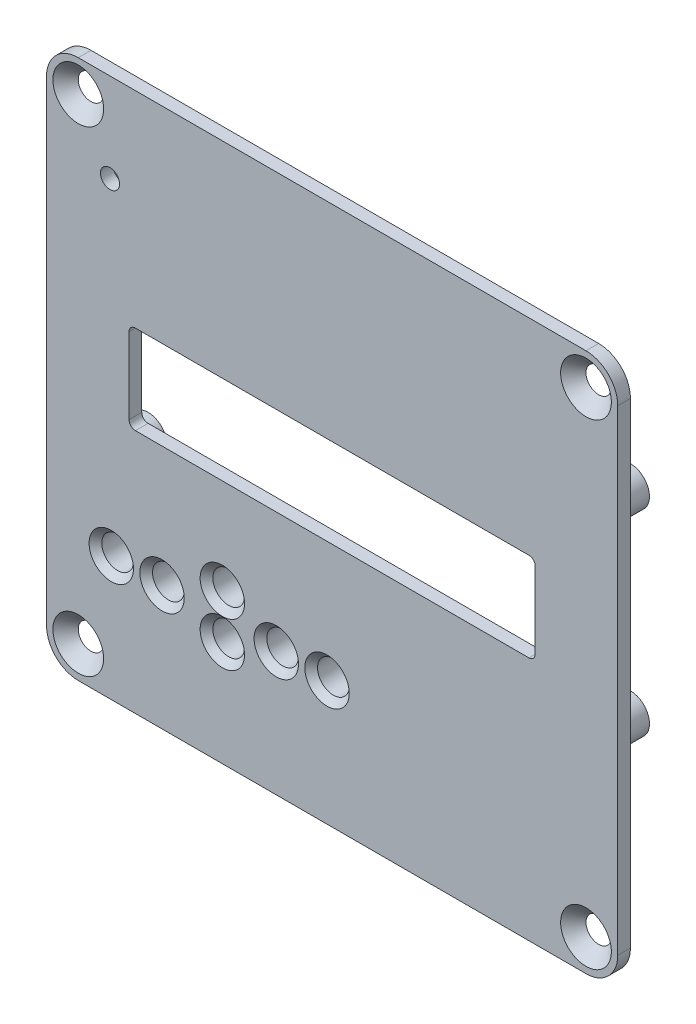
ISO-10303-21;
HEADER;
FILE_DESCRIPTION(('STEP AP214'),'2;1');
FILE_NAME('part.step','',(''),(''),'','','');
FILE_SCHEMA(('AUTOMOTIVE_DESIGN { 1 0 10303 214 1 1 1 1 }'));
ENDSEC;
DATA;
#1=APPLICATION_CONTEXT('core data for automotive mechanical design processes');
#2=APPLICATION_PROTOCOL_DEFINITION('international standard','automotive_design',2000,#1);
#3=PRODUCT_CONTEXT('',#1,'mechanical');
#4=PRODUCT('Part','Part','',(#3));
#5=PRODUCT_RELATED_PRODUCT_CATEGORY('part','',(#4));
#6=PRODUCT_DEFINITION_FORMATION('','',#4);
#7=PRODUCT_DEFINITION_CONTEXT('part definition',#1,'design');
#8=PRODUCT_DEFINITION('design','',#6,#7);
#9=PRODUCT_DEFINITION_SHAPE('','',#8);
#10=(LENGTH_UNIT() NAMED_UNIT(*) SI_UNIT(.MILLI.,.METRE.));
#11=(NAMED_UNIT(*) PLANE_ANGLE_UNIT() SI_UNIT($,.RADIAN.));
#12=(NAMED_UNIT(*) SI_UNIT($,.STERADIAN.) SOLID_ANGLE_UNIT());
#13=UNCERTAINTY_MEASURE_WITH_UNIT(LENGTH_MEASURE(1.E-05),#10,'distance_accuracy_value','');
#14=(GEOMETRIC_REPRESENTATION_CONTEXT(3) GLOBAL_UNCERTAINTY_ASSIGNED_CONTEXT((#13)) GLOBAL_UNIT_ASSIGNED_CONTEXT((#10,
#11,#12)) REPRESENTATION_CONTEXT('',''));
#15=CARTESIAN_POINT('',(0.,0.,0.));
#16=DIRECTION('',(0.,0.,1.));
#17=DIRECTION('',(1.,0.,0.));
#18=AXIS2_PLACEMENT_3D('',#15,#16,#17);
#19=CARTESIAN_POINT('',(40.,-37.5,0.));
#20=DIRECTION('',(0.,0.,1.));
#21=DIRECTION('',(1.,0.,0.));
#22=AXIS2_PLACEMENT_3D('',#19,#20,#21);
#23=PLANE('',#22);
#24=CARTESIAN_POINT('',(-26.7999999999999,-22.9,0.));
#25=DIRECTION('',(0.,0.,1.));
#26=DIRECTION('',(1.,0.,0.));
#27=AXIS2_PLACEMENT_3D('',#24,#25,#26);
#28=CIRCLE('',#27,4.4);
#29=CARTESIAN_POINT('',(-22.3999999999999,-22.9,0.));
#30=VERTEX_POINT('',#29);
#31=CARTESIAN_POINT('',(-30.7999999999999,-21.0669697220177,0.));
#32=VERTEX_POINT('',#31);
#33=EDGE_CURVE('E68',#30,#32,#28,.T.);
#34=ORIENTED_EDGE('',*,*,#33,.T.);
#35=CARTESIAN_POINT('',(-34.7999999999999,-22.9,0.));
#36=DIRECTION('',(0.,0.,1.));
#37=DIRECTION('',(1.,0.,0.));
#38=AXIS2_PLACEMENT_3D('',#35,#36,#37);
#39=CIRCLE('',#38,4.4);
#40=CARTESIAN_POINT('',(-30.7999999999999,-24.7330302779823,0.));
#41=VERTEX_POINT('',#40);
#42=EDGE_CURVE('E423',#32,#41,#39,.T.);
#43=ORIENTED_EDGE('',*,*,#42,.T.);
#44=CARTESIAN_POINT('',(-26.7999999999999,-22.9,0.));
#45=DIRECTION('',(0.,0.,1.));
#46=DIRECTION('',(1.,0.,0.));
#47=AXIS2_PLACEMENT_3D('',#44,#45,#46);
#48=CIRCLE('',#47,4.4);
#49=EDGE_CURVE('E421',#41,#30,#48,.T.);
#50=ORIENTED_EDGE('',*,*,#49,.T.);
#51=EDGE_LOOP('',(#34,#43,#50));
#52=FACE_BOUND('',#51,.T.);
#53=CARTESIAN_POINT('',(-17.2999999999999,-18.9,0.));
#54=DIRECTION('',(0.,0.,1.));
#55=DIRECTION('',(1.,0.,0.));
#56=AXIS2_PLACEMENT_3D('',#53,#54,#55);
#57=CIRCLE('',#56,4.4);
#58=CARTESIAN_POINT('',(-14.6335416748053,-22.4,0.));
#59=VERTEX_POINT('',#58);
#60=CARTESIAN_POINT('',(-19.9664583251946,-22.4,0.));
#61=VERTEX_POINT('',#60);
#62=EDGE_CURVE('E415',#59,#61,#57,.T.);
#63=ORIENTED_EDGE('',*,*,#62,.T.);
#64=CARTESIAN_POINT('',(-17.2999999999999,-25.9,0.));
#65=DIRECTION('',(0.,0.,1.));
#66=DIRECTION('',(1.,0.,0.));
#67=AXIS2_PLACEMENT_3D('',#64,#65,#66);
#68=CIRCLE('',#67,4.4);
#69=EDGE_CURVE('E417',#61,#59,#68,.T.);
#70=ORIENTED_EDGE('',*,*,#69,.T.);
#71=EDGE_LOOP('',(#63,#70));
#72=FACE_BOUND('',#71,.T.);
#73=CARTESIAN_POINT('',(-0.79999999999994,-22.9,0.));
#74=DIRECTION('',(0.,0.,1.));
#75=DIRECTION('',(1.,0.,0.));
#76=AXIS2_PLACEMENT_3D('',#73,#74,#75);
#77=CIRCLE('',#76,4.4);
#78=CARTESIAN_POINT('',(3.60000000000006,-22.9,0.));
#79=VERTEX_POINT('',#78);
#80=CARTESIAN_POINT('',(-4.79999999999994,-21.0669697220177,0.));
#81=VERTEX_POINT('',#80);
#82=EDGE_CURVE('E408',#79,#81,#77,.T.);
#83=ORIENTED_EDGE('',*,*,#82,.T.);
#84=CARTESIAN_POINT('',(-8.79999999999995,-22.9,0.));
#85=DIRECTION('',(0.,0.,1.));
#86=DIRECTION('',(1.,0.,0.));
#87=AXIS2_PLACEMENT_3D('',#84,#85,#86);
#88=CIRCLE('',#87,4.4);
#89=CARTESIAN_POINT('',(-4.79999999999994,-24.7330302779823,0.));
#90=VERTEX_POINT('',#89);
#91=EDGE_CURVE('E412',#81,#90,#88,.T.);
#92=ORIENTED_EDGE('',*,*,#91,.T.);
#93=CARTESIAN_POINT('',(-0.79999999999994,-22.9,0.));
#94=DIRECTION('',(0.,0.,1.));
#95=DIRECTION('',(1.,0.,0.));
#96=AXIS2_PLACEMENT_3D('',#93,#94,#95);
#97=CIRCLE('',#96,4.4);
#98=EDGE_CURVE('E410',#90,#79,#97,.T.);
#99=ORIENTED_EDGE('',*,*,#98,.T.);
#100=EDGE_LOOP('',(#83,#92,#99));
#101=FACE_BOUND('',#100,.T.);
#102=CARTESIAN_POINT('',(-40.,-37.5,0.));
#103=DIRECTION('',(0.,0.,1.));
#104=DIRECTION('',(1.,0.,0.));
#105=AXIS2_PLACEMENT_3D('',#102,#103,#104);
#106=CIRCLE('',#105,2.);
#107=CARTESIAN_POINT('',(-38.,-37.5,0.));
#108=VERTEX_POINT('',#107);
#109=EDGE_CURVE('E741',#108,#108,#106,.T.);
#110=ORIENTED_EDGE('',*,*,#109,.T.);
#111=EDGE_LOOP('',(#110));
#112=FACE_BOUND('',#111,.T.);
#113=CARTESIAN_POINT('',(40.,-37.5,0.));
#114=DIRECTION('',(0.,0.,1.));
#115=DIRECTION('',(1.,0.,0.));
#116=AXIS2_PLACEMENT_3D('',#113,#114,#115);
#117=CIRCLE('',#116,2.);
#118=CARTESIAN_POINT('',(42.,-37.5,0.));
#119=VERTEX_POINT('',#118);
#120=EDGE_CURVE('E737',#119,#119,#117,.T.);
#121=ORIENTED_EDGE('',*,*,#120,.T.);
#122=EDGE_LOOP('',(#121));
#123=FACE_BOUND('',#122,.T.);
#124=CARTESIAN_POINT('',(40.,37.5,0.));
#125=DIRECTION('',(0.,0.,1.));
#126=DIRECTION('',(1.,0.,0.));
#127=AXIS2_PLACEMENT_3D('',#124,#125,#126);
#128=CIRCLE('',#127,2.);
#129=CARTESIAN_POINT('',(42.,37.5,0.));
#130=VERTEX_POINT('',#129);
#131=EDGE_CURVE('E732',#130,#130,#128,.T.);
#132=ORIENTED_EDGE('',*,*,#131,.T.);
#133=EDGE_LOOP('',(#132));
#134=FACE_BOUND('',#133,.T.);
#135=CARTESIAN_POINT('',(-40.,37.5,0.));
#136=DIRECTION('',(0.,0.,1.));
#137=DIRECTION('',(1.,0.,0.));
#138=AXIS2_PLACEMENT_3D('',#135,#136,#137);
#139=CIRCLE('',#138,2.);
#140=CARTESIAN_POINT('',(-38.,37.5,0.));
#141=VERTEX_POINT('',#140);
#142=EDGE_CURVE('E729',#141,#141,#139,.T.);
#143=ORIENTED_EDGE('',*,*,#142,.T.);
#144=EDGE_LOOP('',(#143));
#145=FACE_BOUND('',#144,.T.);
#146=CARTESIAN_POINT('',(38.,-12.4,0.));
#147=DIRECTION('',(0.,0.,1.));
#148=DIRECTION('',(1.,0.,0.));
#149=AXIS2_PLACEMENT_3D('',#146,#147,#148);
#150=CIRCLE('',#149,4.);
#151=CARTESIAN_POINT('',(42.,-12.4,0.));
#152=VERTEX_POINT('',#151);
#153=EDGE_CURVE('E341',#152,#152,#150,.T.);
#154=ORIENTED_EDGE('',*,*,#153,.T.);
#155=EDGE_LOOP('',(#154));
#156=FACE_BOUND('',#155,.T.);
#157=CARTESIAN_POINT('',(-38.,-12.4,0.));
#158=DIRECTION('',(0.,0.,1.));
#159=DIRECTION('',(1.,0.,0.));
#160=AXIS2_PLACEMENT_3D('',#157,#158,#159);
#161=CIRCLE('',#160,4.);
#162=CARTESIAN_POINT('',(-34.,-12.4,0.));
#163=VERTEX_POINT('',#162);
#164=EDGE_CURVE('E338',#163,#163,#161,.T.);
#165=ORIENTED_EDGE('',*,*,#164,.T.);
#166=EDGE_LOOP('',(#165));
#167=FACE_BOUND('',#166,.T.);
#168=CARTESIAN_POINT('',(-38.,18.6,0.));
#169=DIRECTION('',(0.,0.,1.));
#170=DIRECTION('',(1.,0.,0.));
#171=AXIS2_PLACEMENT_3D('',#168,#169,#170);
#172=CIRCLE('',#171,4.);
#173=CARTESIAN_POINT('',(-34.,18.6,0.));
#174=VERTEX_POINT('',#173);
#175=EDGE_CURVE('E335',#174,#174,#172,.T.);
#176=ORIENTED_EDGE('',*,*,#175,.T.);
#177=EDGE_LOOP('',(#176));
#178=FACE_BOUND('',#177,.T.);
#179=CARTESIAN_POINT('',(38.,18.6,0.));
#180=DIRECTION('',(0.,0.,1.));
#181=DIRECTION('',(1.,0.,0.));
#182=AXIS2_PLACEMENT_3D('',#179,#180,#181);
#183=CIRCLE('',#182,4.00000000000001);
#184=CARTESIAN_POINT('',(42.,18.6,0.));
#185=VERTEX_POINT('',#184);
#186=EDGE_CURVE('E332',#185,#185,#183,.T.);
#187=ORIENTED_EDGE('',*,*,#186,.T.);
#188=EDGE_LOOP('',(#187));
#189=FACE_BOUND('',#188,.T.);
#190=CARTESIAN_POINT('',(-35.,28.5,0.));
#191=DIRECTION('',(0.,0.,1.));
#192=DIRECTION('',(1.,0.,0.));
#193=AXIS2_PLACEMENT_3D('',#190,#191,#192);
#194=CIRCLE('',#193,1.5);
#195=CARTESIAN_POINT('',(-33.5,28.5,0.));
#196=VERTEX_POINT('',#195);
#197=EDGE_CURVE('E242',#196,#196,#194,.T.);
#198=ORIENTED_EDGE('',*,*,#197,.T.);
#199=EDGE_LOOP('',(#198));
#200=FACE_BOUND('',#199,.T.);
#201=DIRECTION('',(-1.,0.,0.));
#202=VECTOR('',#201,1.);
#203=CARTESIAN_POINT('',(-31.,10.1,0.));
#204=LINE('',#203,#202);
#205=CARTESIAN_POINT('',(31.0000000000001,10.1,0.));
#206=VERTEX_POINT('',#205);
#207=CARTESIAN_POINT('',(-31.,10.1,0.));
#208=VERTEX_POINT('',#207);
#209=EDGE_CURVE('E205',#206,#208,#204,.T.);
#210=ORIENTED_EDGE('',*,*,#209,.T.);
#211=CARTESIAN_POINT('',(-30.9999999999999,9.09999999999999,0.));
#212=DIRECTION('',(0.,0.,1.));
#213=DIRECTION('',(-1.,0.,0.));
#214=AXIS2_PLACEMENT_3D('',#211,#212,#213);
#215=CIRCLE('',#214,1.00000000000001);
#216=CARTESIAN_POINT('',(-32.,9.10000000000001,0.));
#217=VERTEX_POINT('',#216);
#218=EDGE_CURVE('E197',#208,#217,#215,.T.);
#219=ORIENTED_EDGE('',*,*,#218,.T.);
#220=DIRECTION('',(0.,-1.,0.));
#221=VECTOR('',#220,1.);
#222=CARTESIAN_POINT('',(-32.,9.10000000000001,0.));
#223=LINE('',#222,#221);
#224=CARTESIAN_POINT('',(-32.,-2.89999999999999,0.));
#225=VERTEX_POINT('',#224);
#226=EDGE_CURVE('E209',#217,#225,#223,.T.);
#227=ORIENTED_EDGE('',*,*,#226,.T.);
#228=CARTESIAN_POINT('',(-31.,-2.89999999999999,0.));
#229=DIRECTION('',(0.,0.,1.));
#230=DIRECTION('',(1.,0.,0.));
#231=AXIS2_PLACEMENT_3D('',#228,#229,#230);
#232=CIRCLE('',#231,1.00000000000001);
#233=CARTESIAN_POINT('',(-31.,-3.89999999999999,0.));
#234=VERTEX_POINT('',#233);
#235=EDGE_CURVE('E213',#225,#234,#232,.T.);
#236=ORIENTED_EDGE('',*,*,#235,.T.);
#237=DIRECTION('',(1.,0.,0.));
#238=VECTOR('',#237,1.);
#239=CARTESIAN_POINT('',(-31.,-3.89999999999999,0.));
#240=LINE('',#239,#238);
#241=CARTESIAN_POINT('',(31.0000000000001,-3.89999999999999,0.));
#242=VERTEX_POINT('',#241);
#243=EDGE_CURVE('E228',#234,#242,#240,.T.);
#244=ORIENTED_EDGE('',*,*,#243,.T.);
#245=CARTESIAN_POINT('',(31.0000000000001,-2.89999999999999,0.));
#246=DIRECTION('',(0.,0.,1.));
#247=DIRECTION('',(1.,0.,0.));
#248=AXIS2_PLACEMENT_3D('',#245,#246,#247);
#249=CIRCLE('',#248,1.);
#250=CARTESIAN_POINT('',(32.0000000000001,-2.89999999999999,0.));
#251=VERTEX_POINT('',#250);
#252=EDGE_CURVE('E231',#242,#251,#249,.T.);
#253=ORIENTED_EDGE('',*,*,#252,.T.);
#254=DIRECTION('',(0.,1.,0.));
#255=VECTOR('',#254,1.);
#256=CARTESIAN_POINT('',(32.0000000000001,9.10000000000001,0.));
#257=LINE('',#256,#255);
#258=CARTESIAN_POINT('',(32.0000000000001,9.10000000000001,0.));
#259=VERTEX_POINT('',#258);
#260=EDGE_CURVE('E234',#251,#259,#257,.T.);
#261=ORIENTED_EDGE('',*,*,#260,.T.);
#262=CARTESIAN_POINT('',(31.0000000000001,9.10000000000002,0.));
#263=DIRECTION('',(0.,0.,1.));
#264=DIRECTION('',(-1.,0.,0.));
#265=AXIS2_PLACEMENT_3D('',#262,#263,#264);
#266=CIRCLE('',#265,1.);
#267=EDGE_CURVE('E237',#259,#206,#266,.T.);
#268=ORIENTED_EDGE('',*,*,#267,.T.);
#269=EDGE_LOOP('',(#210,#219,#227,#236,#244,#253,#261,#268));
#270=FACE_BOUND('',#269,.T.);
#271=CARTESIAN_POINT('',(40.,-37.5,0.));
#272=DIRECTION('',(0.,0.,1.));
#273=DIRECTION('',(1.,0.,0.));
#274=AXIS2_PLACEMENT_3D('',#271,#272,#273);
#275=CIRCLE('',#274,5.);
#276=CARTESIAN_POINT('',(40.,-42.5,0.));
#277=VERTEX_POINT('',#276);
#278=CARTESIAN_POINT('',(45.,-37.5,0.));
#279=VERTEX_POINT('',#278);
#280=EDGE_CURVE('E260',#277,#279,#275,.T.);
#281=ORIENTED_EDGE('',*,*,#280,.F.);
#282=DIRECTION('',(1.,0.,0.));
#283=VECTOR('',#282,1.);
#284=CARTESIAN_POINT('',(-40.,-42.5,0.));
#285=LINE('',#284,#283);
#286=CARTESIAN_POINT('',(-40.,-42.5,0.));
#287=VERTEX_POINT('',#286);
#288=EDGE_CURVE('E276',#287,#277,#285,.T.);
#289=ORIENTED_EDGE('',*,*,#288,.F.);
#290=CARTESIAN_POINT('',(-40.,-37.5,0.));
#291=DIRECTION('',(0.,0.,1.));
#292=DIRECTION('',(1.,0.,0.));
#293=AXIS2_PLACEMENT_3D('',#290,#291,#292);
#294=CIRCLE('',#293,5.);
#295=CARTESIAN_POINT('',(-45.,-37.5,0.));
#296=VERTEX_POINT('',#295);
#297=EDGE_CURVE('E303',#296,#287,#294,.T.);
#298=ORIENTED_EDGE('',*,*,#297,.F.);
#299=DIRECTION('',(0.,-1.,0.));
#300=VECTOR('',#299,1.);
#301=CARTESIAN_POINT('',(-45.,37.5,0.));
#302=LINE('',#301,#300);
#303=CARTESIAN_POINT('',(-45.,37.5,0.));
#304=VERTEX_POINT('',#303);
#305=EDGE_CURVE('E301',#304,#296,#302,.T.);
#306=ORIENTED_EDGE('',*,*,#305,.F.);
#307=CARTESIAN_POINT('',(-40.,37.5,0.));
#308=DIRECTION('',(0.,0.,1.));
#309=DIRECTION('',(1.,0.,0.));
#310=AXIS2_PLACEMENT_3D('',#307,#308,#309);
#311=CIRCLE('',#310,5.);
#312=CARTESIAN_POINT('',(-40.,42.5,0.));
#313=VERTEX_POINT('',#312);
#314=EDGE_CURVE('E299',#313,#304,#311,.T.);
#315=ORIENTED_EDGE('',*,*,#314,.F.);
#316=DIRECTION('',(-1.,0.,0.));
#317=VECTOR('',#316,1.);
#318=CARTESIAN_POINT('',(-40.,42.5,0.));
#319=LINE('',#318,#317);
#320=CARTESIAN_POINT('',(39.9999999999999,42.5,0.));
#321=VERTEX_POINT('',#320);
#322=EDGE_CURVE('E297',#321,#313,#319,.T.);
#323=ORIENTED_EDGE('',*,*,#322,.F.);
#324=CARTESIAN_POINT('',(40.,37.5,0.));
#325=DIRECTION('',(0.,0.,1.));
#326=DIRECTION('',(-1.,0.,0.));
#327=AXIS2_PLACEMENT_3D('',#324,#325,#326);
#328=CIRCLE('',#327,5.);
#329=CARTESIAN_POINT('',(45.,37.5,0.));
#330=VERTEX_POINT('',#329);
#331=EDGE_CURVE('E295',#330,#321,#328,.T.);
#332=ORIENTED_EDGE('',*,*,#331,.F.);
#333=DIRECTION('',(0.,1.,0.));
#334=VECTOR('',#333,1.);
#335=CARTESIAN_POINT('',(45.,37.5,0.));
#336=LINE('',#335,#334);
#337=EDGE_CURVE('E293',#279,#330,#336,.T.);
#338=ORIENTED_EDGE('',*,*,#337,.F.);
#339=EDGE_LOOP('',(#281,#289,#298,#306,#315,#323,#332,#338));
#340=FACE_BOUND('',#339,.T.);
#341=ADVANCED_FACE('F39',(#52,#72,#101,#112,#123,#134,#145,#156,#167,#178,#189,#200,#270,#340),
#23,.F.);
#342=CARTESIAN_POINT('',(40.,-37.5,2.));
#343=DIRECTION('',(0.,0.,-1.));
#344=DIRECTION('',(-1.,0.,0.));
#345=AXIS2_PLACEMENT_3D('',#342,#343,#344);
#346=CYLINDRICAL_SURFACE('',#345,5.);
#347=ORIENTED_EDGE('',*,*,#280,.T.);
#348=DIRECTION('',(0.,0.,-1.));
#349=VECTOR('',#348,1.);
#350=CARTESIAN_POINT('',(45.,-37.5,2.));
#351=LINE('',#350,#349);
#352=CARTESIAN_POINT('',(45.,-37.5,2.));
#353=VERTEX_POINT('',#352);
#354=EDGE_CURVE('E326',#353,#279,#351,.T.);
#355=ORIENTED_EDGE('',*,*,#354,.F.);
#356=CARTESIAN_POINT('',(40.,-37.5,2.));
#357=DIRECTION('',(0.,0.,1.));
#358=DIRECTION('',(1.,0.,0.));
#359=AXIS2_PLACEMENT_3D('',#356,#357,#358);
#360=CIRCLE('',#359,5.);
#361=CARTESIAN_POINT('',(40.,-42.5,2.));
#362=VERTEX_POINT('',#361);
#363=EDGE_CURVE('E272',#362,#353,#360,.T.);
#364=ORIENTED_EDGE('',*,*,#363,.F.);
#365=DIRECTION('',(0.,0.,-1.));
#366=VECTOR('',#365,1.);
#367=CARTESIAN_POINT('',(40.,-42.5,2.));
#368=LINE('',#367,#366);
#369=EDGE_CURVE('E290',#362,#277,#368,.T.);
#370=ORIENTED_EDGE('',*,*,#369,.T.);
#371=EDGE_LOOP('',(#347,#355,#364,#370));
#372=FACE_BOUND('',#371,.T.);
#373=ADVANCED_FACE('F478',(#372),#346,.T.);
#374=CARTESIAN_POINT('',(45.,37.5,2.));
#375=DIRECTION('',(-1.,0.,0.));
#376=DIRECTION('',(0.,-1.,0.));
#377=AXIS2_PLACEMENT_3D('',#374,#375,#376);
#378=PLANE('',#377);
#379=ORIENTED_EDGE('',*,*,#337,.T.);
#380=DIRECTION('',(0.,0.,-1.));
#381=VECTOR('',#380,1.);
#382=CARTESIAN_POINT('',(45.,37.5,2.));
#383=LINE('',#382,#381);
#384=CARTESIAN_POINT('',(45.,37.5,2.));
#385=VERTEX_POINT('',#384);
#386=EDGE_CURVE('E323',#385,#330,#383,.T.);
#387=ORIENTED_EDGE('',*,*,#386,.F.);
#388=DIRECTION('',(0.,1.,0.));
#389=VECTOR('',#388,1.);
#390=CARTESIAN_POINT('',(45.,37.5,2.));
#391=LINE('',#390,#389);
#392=EDGE_CURVE('E275',#353,#385,#391,.T.);
#393=ORIENTED_EDGE('',*,*,#392,.F.);
#394=ORIENTED_EDGE('',*,*,#354,.T.);
#395=EDGE_LOOP('',(#379,#387,#393,#394));
#396=FACE_BOUND('',#395,.T.);
#397=ADVANCED_FACE('F485',(#396),#378,.F.);
#398=CARTESIAN_POINT('',(40.,37.5,2.));
#399=DIRECTION('',(0.,0.,-1.));
#400=DIRECTION('',(-1.,0.,0.));
#401=AXIS2_PLACEMENT_3D('',#398,#399,#400);
#402=CYLINDRICAL_SURFACE('',#401,5.);
#403=ORIENTED_EDGE('',*,*,#331,.T.);
#404=DIRECTION('',(0.,0.,-1.));
#405=VECTOR('',#404,1.);
#406=CARTESIAN_POINT('',(39.9999999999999,42.5,2.));
#407=LINE('',#406,#405);
#408=CARTESIAN_POINT('',(39.9999999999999,42.5,2.));
#409=VERTEX_POINT('',#408);
#410=EDGE_CURVE('E320',#409,#321,#407,.T.);
#411=ORIENTED_EDGE('',*,*,#410,.F.);
#412=CARTESIAN_POINT('',(40.,37.5,2.));
#413=DIRECTION('',(0.,0.,1.));
#414=DIRECTION('',(-1.,0.,0.));
#415=AXIS2_PLACEMENT_3D('',#412,#413,#414);
#416=CIRCLE('',#415,5.);
#417=EDGE_CURVE('E278',#385,#409,#416,.T.);
#418=ORIENTED_EDGE('',*,*,#417,.F.);
#419=ORIENTED_EDGE('',*,*,#386,.T.);
#420=EDGE_LOOP('',(#403,#411,#418,#419));
#421=FACE_BOUND('',#420,.T.);
#422=ADVANCED_FACE('F596',(#421),#402,.T.);
#423=CARTESIAN_POINT('',(-40.,42.5,2.));
#424=DIRECTION('',(0.,-1.,0.));
#425=DIRECTION('',(0.,0.,-1.));
#426=AXIS2_PLACEMENT_3D('',#423,#424,#425);
#427=PLANE('',#426);
#428=ORIENTED_EDGE('',*,*,#322,.T.);
#429=DIRECTION('',(0.,0.,-1.));
#430=VECTOR('',#429,1.);
#431=CARTESIAN_POINT('',(-40.,42.5,2.));
#432=LINE('',#431,#430);
#433=CARTESIAN_POINT('',(-40.,42.5,2.));
#434=VERTEX_POINT('',#433);
#435=EDGE_CURVE('E317',#434,#313,#432,.T.);
#436=ORIENTED_EDGE('',*,*,#435,.F.);
#437=DIRECTION('',(-1.,0.,0.));
#438=VECTOR('',#437,1.);
#439=CARTESIAN_POINT('',(-40.,42.5,2.));
#440=LINE('',#439,#438);
#441=EDGE_CURVE('E280',#409,#434,#440,.T.);
#442=ORIENTED_EDGE('',*,*,#441,.F.);
#443=ORIENTED_EDGE('',*,*,#410,.T.);
#444=EDGE_LOOP('',(#428,#436,#442,#443));
#445=FACE_BOUND('',#444,.T.);
#446=ADVANCED_FACE('F602',(#445),#427,.F.);
#447=CARTESIAN_POINT('',(-40.,37.5,2.));
#448=DIRECTION('',(0.,0.,-1.));
#449=DIRECTION('',(-1.,0.,0.));
#450=AXIS2_PLACEMENT_3D('',#447,#448,#449);
#451=CYLINDRICAL_SURFACE('',#450,5.);
#452=ORIENTED_EDGE('',*,*,#314,.T.);
#453=DIRECTION('',(0.,0.,-1.));
#454=VECTOR('',#453,1.);
#455=CARTESIAN_POINT('',(-45.,37.5,2.));
#456=LINE('',#455,#454);
#457=CARTESIAN_POINT('',(-45.,37.5,2.));
#458=VERTEX_POINT('',#457);
#459=EDGE_CURVE('E314',#458,#304,#456,.T.);
#460=ORIENTED_EDGE('',*,*,#459,.F.);
#461=CARTESIAN_POINT('',(-40.,37.5,2.));
#462=DIRECTION('',(0.,0.,1.));
#463=DIRECTION('',(1.,0.,0.));
#464=AXIS2_PLACEMENT_3D('',#461,#462,#463);
#465=CIRCLE('',#464,5.);
#466=EDGE_CURVE('E282',#434,#458,#465,.T.);
#467=ORIENTED_EDGE('',*,*,#466,.F.);
#468=ORIENTED_EDGE('',*,*,#435,.T.);
#469=EDGE_LOOP('',(#452,#460,#467,#468));
#470=FACE_BOUND('',#469,.T.);
#471=ADVANCED_FACE('F606',(#470),#451,.T.);
#472=CARTESIAN_POINT('',(-45.,37.5,2.));
#473=DIRECTION('',(1.,0.,0.));
#474=DIRECTION('',(0.,1.,0.));
#475=AXIS2_PLACEMENT_3D('',#472,#473,#474);
#476=PLANE('',#475);
#477=ORIENTED_EDGE('',*,*,#305,.T.);
#478=DIRECTION('',(0.,0.,-1.));
#479=VECTOR('',#478,1.);
#480=CARTESIAN_POINT('',(-45.,-37.5,2.));
#481=LINE('',#480,#479);
#482=CARTESIAN_POINT('',(-45.,-37.5,2.));
#483=VERTEX_POINT('',#482);
#484=EDGE_CURVE('E311',#483,#296,#481,.T.);
#485=ORIENTED_EDGE('',*,*,#484,.F.);
#486=DIRECTION('',(0.,-1.,0.));
#487=VECTOR('',#486,1.);
#488=CARTESIAN_POINT('',(-45.,37.5,2.));
#489=LINE('',#488,#487);
#490=EDGE_CURVE('E284',#458,#483,#489,.T.);
#491=ORIENTED_EDGE('',*,*,#490,.F.);
#492=ORIENTED_EDGE('',*,*,#459,.T.);
#493=EDGE_LOOP('',(#477,#485,#491,#492));
#494=FACE_BOUND('',#493,.T.);
#495=ADVANCED_FACE('F611',(#494),#476,.F.);
#496=CARTESIAN_POINT('',(-40.,-37.5,2.));
#497=DIRECTION('',(0.,0.,-1.));
#498=DIRECTION('',(-1.,0.,0.));
#499=AXIS2_PLACEMENT_3D('',#496,#497,#498);
#500=CYLINDRICAL_SURFACE('',#499,5.);
#501=ORIENTED_EDGE('',*,*,#297,.T.);
#502=DIRECTION('',(0.,0.,-1.));
#503=VECTOR('',#502,1.);
#504=CARTESIAN_POINT('',(-40.,-42.5,2.));
#505=LINE('',#504,#503);
#506=CARTESIAN_POINT('',(-40.,-42.5,2.));
#507=VERTEX_POINT('',#506);
#508=EDGE_CURVE('E308',#507,#287,#505,.T.);
#509=ORIENTED_EDGE('',*,*,#508,.F.);
#510=CARTESIAN_POINT('',(-40.,-37.5,2.));
#511=DIRECTION('',(0.,0.,1.));
#512=DIRECTION('',(1.,0.,0.));
#513=AXIS2_PLACEMENT_3D('',#510,#511,#512);
#514=CIRCLE('',#513,5.);
#515=EDGE_CURVE('E286',#483,#507,#514,.T.);
#516=ORIENTED_EDGE('',*,*,#515,.F.);
#517=ORIENTED_EDGE('',*,*,#484,.T.);
#518=EDGE_LOOP('',(#501,#509,#516,#517));
#519=FACE_BOUND('',#518,.T.);
#520=ADVANCED_FACE('F615',(#519),#500,.T.);
#521=CARTESIAN_POINT('',(-40.,-42.5,2.));
#522=DIRECTION('',(0.,1.,0.));
#523=DIRECTION('',(0.,0.,1.));
#524=AXIS2_PLACEMENT_3D('',#521,#522,#523);
#525=PLANE('',#524);
#526=ORIENTED_EDGE('',*,*,#288,.T.);
#527=ORIENTED_EDGE('',*,*,#369,.F.);
#528=DIRECTION('',(1.,0.,0.));
#529=VECTOR('',#528,1.);
#530=CARTESIAN_POINT('',(-40.,-42.5,2.));
#531=LINE('',#530,#529);
#532=EDGE_CURVE('E288',#507,#362,#531,.T.);
#533=ORIENTED_EDGE('',*,*,#532,.F.);
#534=ORIENTED_EDGE('',*,*,#508,.T.);
#535=EDGE_LOOP('',(#526,#527,#533,#534));
#536=FACE_BOUND('',#535,.T.);
#537=ADVANCED_FACE('F581',(#536),#525,.F.);
#538=CARTESIAN_POINT('',(40.,-37.5,2.));
#539=DIRECTION('',(0.,0.,1.));
#540=DIRECTION('',(1.,0.,0.));
#541=AXIS2_PLACEMENT_3D('',#538,#539,#540);
#542=PLANE('',#541);
#543=CARTESIAN_POINT('',(-40.,-37.5,2.));
#544=DIRECTION('',(0.,0.,1.));
#545=DIRECTION('',(1.,0.,0.));
#546=AXIS2_PLACEMENT_3D('',#543,#544,#545);
#547=CIRCLE('',#546,3.99999999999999);
#548=CARTESIAN_POINT('',(-36.,-37.5,2.));
#549=VERTEX_POINT('',#548);
#550=EDGE_CURVE('E402',#549,#549,#547,.F.);
#551=ORIENTED_EDGE('',*,*,#550,.T.);
#552=EDGE_LOOP('',(#551));
#553=FACE_BOUND('',#552,.T.);
#554=CARTESIAN_POINT('',(40.,-37.5,2.));
#555=DIRECTION('',(0.,0.,1.));
#556=DIRECTION('',(1.,0.,0.));
#557=AXIS2_PLACEMENT_3D('',#554,#555,#556);
#558=CIRCLE('',#557,3.99999999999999);
#559=CARTESIAN_POINT('',(43.9999999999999,-37.5,2.));
#560=VERTEX_POINT('',#559);
#561=EDGE_CURVE('E399',#560,#560,#558,.F.);
#562=ORIENTED_EDGE('',*,*,#561,.T.);
#563=EDGE_LOOP('',(#562));
#564=FACE_BOUND('',#563,.T.);
#565=CARTESIAN_POINT('',(40.,37.5,2.));
#566=DIRECTION('',(0.,0.,1.));
#567=DIRECTION('',(1.,0.,0.));
#568=AXIS2_PLACEMENT_3D('',#565,#566,#567);
#569=CIRCLE('',#568,3.99999999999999);
#570=CARTESIAN_POINT('',(43.9999999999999,37.5,2.));
#571=VERTEX_POINT('',#570);
#572=EDGE_CURVE('E396',#571,#571,#569,.F.);
#573=ORIENTED_EDGE('',*,*,#572,.T.);
#574=EDGE_LOOP('',(#573));
#575=FACE_BOUND('',#574,.T.);
#576=CARTESIAN_POINT('',(-40.,37.5,2.));
#577=DIRECTION('',(0.,0.,1.));
#578=DIRECTION('',(1.,0.,0.));
#579=AXIS2_PLACEMENT_3D('',#576,#577,#578);
#580=CIRCLE('',#579,3.99999999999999);
#581=CARTESIAN_POINT('',(-36.,37.5,2.));
#582=VERTEX_POINT('',#581);
#583=EDGE_CURVE('E393',#582,#582,#580,.F.);
#584=ORIENTED_EDGE('',*,*,#583,.T.);
#585=EDGE_LOOP('',(#584));
#586=FACE_BOUND('',#585,.T.);
#587=CARTESIAN_POINT('',(-0.79999999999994,-22.9,2.));
#588=DIRECTION('',(0.,0.,1.));
#589=DIRECTION('',(1.,0.,0.));
#590=AXIS2_PLACEMENT_3D('',#587,#588,#589);
#591=CIRCLE('',#590,3.50000000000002);
#592=CARTESIAN_POINT('',(2.70000000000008,-22.9,2.));
#593=VERTEX_POINT('',#592);
#594=EDGE_CURVE('E375',#593,#593,#591,.F.);
#595=ORIENTED_EDGE('',*,*,#594,.T.);
#596=EDGE_LOOP('',(#595));
#597=FACE_BOUND('',#596,.T.);
#598=CARTESIAN_POINT('',(-8.79999999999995,-22.9,2.));
#599=DIRECTION('',(0.,0.,1.));
#600=DIRECTION('',(1.,0.,0.));
#601=AXIS2_PLACEMENT_3D('',#598,#599,#600);
#602=CIRCLE('',#601,3.50000000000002);
#603=CARTESIAN_POINT('',(-5.29999999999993,-22.9,2.));
#604=VERTEX_POINT('',#603);
#605=EDGE_CURVE('E372',#604,#604,#602,.F.);
#606=ORIENTED_EDGE('',*,*,#605,.T.);
#607=EDGE_LOOP('',(#606));
#608=FACE_BOUND('',#607,.T.);
#609=CARTESIAN_POINT('',(-17.2999999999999,-18.9,2.));
#610=DIRECTION('',(0.,0.,1.));
#611=DIRECTION('',(1.,0.,0.));
#612=AXIS2_PLACEMENT_3D('',#609,#610,#611);
#613=CIRCLE('',#612,3.50000000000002);
#614=CARTESIAN_POINT('',(-17.2999999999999,-22.4,2.));
#615=VERTEX_POINT('',#614);
#616=CARTESIAN_POINT('',(-13.7999999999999,-18.9,2.));
#617=VERTEX_POINT('',#616);
#618=EDGE_CURVE('E367',#615,#617,#613,.F.);
#619=ORIENTED_EDGE('',*,*,#618,.T.);
#620=CARTESIAN_POINT('',(-17.2999999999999,-18.9,2.));
#621=DIRECTION('',(0.,0.,1.));
#622=DIRECTION('',(1.,0.,0.));
#623=AXIS2_PLACEMENT_3D('',#620,#621,#622);
#624=CIRCLE('',#623,3.50000000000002);
#625=EDGE_CURVE('E369',#617,#615,#624,.F.);
#626=ORIENTED_EDGE('',*,*,#625,.T.);
#627=CARTESIAN_POINT('',(-17.2999999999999,-25.9,2.));
#628=DIRECTION('',(0.,0.,1.));
#629=DIRECTION('',(1.,0.,0.));
#630=AXIS2_PLACEMENT_3D('',#627,#628,#629);
#631=CIRCLE('',#630,3.50000000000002);
#632=CARTESIAN_POINT('',(-13.7999999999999,-25.9,2.));
#633=VERTEX_POINT('',#632);
#634=EDGE_CURVE('E362',#615,#633,#631,.F.);
#635=ORIENTED_EDGE('',*,*,#634,.T.);
#636=CARTESIAN_POINT('',(-17.2999999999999,-25.9,2.));
#637=DIRECTION('',(0.,0.,1.));
#638=DIRECTION('',(1.,0.,0.));
#639=AXIS2_PLACEMENT_3D('',#636,#637,#638);
#640=CIRCLE('',#639,3.50000000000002);
#641=EDGE_CURVE('E364',#633,#615,#640,.F.);
#642=ORIENTED_EDGE('',*,*,#641,.T.);
#643=EDGE_LOOP('',(#619,#626,#635,#642));
#644=FACE_BOUND('',#643,.T.);
#645=CARTESIAN_POINT('',(-26.7999999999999,-22.9,2.));
#646=DIRECTION('',(0.,0.,1.));
#647=DIRECTION('',(1.,0.,0.));
#648=AXIS2_PLACEMENT_3D('',#645,#646,#647);
#649=CIRCLE('',#648,3.50000000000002);
#650=CARTESIAN_POINT('',(-23.2999999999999,-22.9,2.));
#651=VERTEX_POINT('',#650);
#652=EDGE_CURVE('E359',#651,#651,#649,.F.);
#653=ORIENTED_EDGE('',*,*,#652,.T.);
#654=EDGE_LOOP('',(#653));
#655=FACE_BOUND('',#654,.T.);
#656=CARTESIAN_POINT('',(-34.7999999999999,-22.9,2.));
#657=DIRECTION('',(0.,0.,1.));
#658=DIRECTION('',(1.,0.,0.));
#659=AXIS2_PLACEMENT_3D('',#656,#657,#658);
#660=CIRCLE('',#659,3.50000000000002);
#661=CARTESIAN_POINT('',(-31.2999999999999,-22.9,2.));
#662=VERTEX_POINT('',#661);
#663=EDGE_CURVE('E356',#662,#662,#660,.F.);
#664=ORIENTED_EDGE('',*,*,#663,.T.);
#665=EDGE_LOOP('',(#664));
#666=FACE_BOUND('',#665,.T.);
#667=CARTESIAN_POINT('',(-35.,28.5,2.));
#668=DIRECTION('',(0.,0.,1.));
#669=DIRECTION('',(1.,0.,0.));
#670=AXIS2_PLACEMENT_3D('',#667,#668,#669);
#671=CIRCLE('',#670,1.5);
#672=CARTESIAN_POINT('',(-33.5,28.5,2.));
#673=VERTEX_POINT('',#672);
#674=EDGE_CURVE('E224',#673,#673,#671,.T.);
#675=ORIENTED_EDGE('',*,*,#674,.F.);
#676=EDGE_LOOP('',(#675));
#677=FACE_BOUND('',#676,.T.);
#678=CARTESIAN_POINT('',(-30.9999999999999,9.09999999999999,2.));
#679=DIRECTION('',(0.,0.,1.));
#680=DIRECTION('',(-1.,0.,0.));
#681=AXIS2_PLACEMENT_3D('',#678,#679,#680);
#682=CIRCLE('',#681,1.00000000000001);
#683=CARTESIAN_POINT('',(-31.,10.1,2.));
#684=VERTEX_POINT('',#683);
#685=CARTESIAN_POINT('',(-32.,9.10000000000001,2.));
#686=VERTEX_POINT('',#685);
#687=EDGE_CURVE('E200',#684,#686,#682,.T.);
#688=ORIENTED_EDGE('',*,*,#687,.F.);
#689=DIRECTION('',(-1.,0.,0.));
#690=VECTOR('',#689,1.);
#691=CARTESIAN_POINT('',(-31.,10.1,2.));
#692=LINE('',#691,#690);
#693=CARTESIAN_POINT('',(31.0000000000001,10.1,2.));
#694=VERTEX_POINT('',#693);
#695=EDGE_CURVE('E218',#694,#684,#692,.T.);
#696=ORIENTED_EDGE('',*,*,#695,.F.);
#697=CARTESIAN_POINT('',(31.0000000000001,9.10000000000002,2.));
#698=DIRECTION('',(0.,0.,1.));
#699=DIRECTION('',(-1.,0.,0.));
#700=AXIS2_PLACEMENT_3D('',#697,#698,#699);
#701=CIRCLE('',#700,1.);
#702=CARTESIAN_POINT('',(32.0000000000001,9.10000000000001,2.));
#703=VERTEX_POINT('',#702);
#704=EDGE_CURVE('E221',#703,#694,#701,.T.);
#705=ORIENTED_EDGE('',*,*,#704,.F.);
#706=DIRECTION('',(0.,1.,0.));
#707=VECTOR('',#706,1.);
#708=CARTESIAN_POINT('',(32.0000000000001,9.10000000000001,2.));
#709=LINE('',#708,#707);
#710=CARTESIAN_POINT('',(32.0000000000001,-2.89999999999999,2.));
#711=VERTEX_POINT('',#710);
#712=EDGE_CURVE('E253',#711,#703,#709,.T.);
#713=ORIENTED_EDGE('',*,*,#712,.F.);
#714=CARTESIAN_POINT('',(31.0000000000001,-2.89999999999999,2.));
#715=DIRECTION('',(0.,0.,1.));
#716=DIRECTION('',(1.,0.,0.));
#717=AXIS2_PLACEMENT_3D('',#714,#715,#716);
#718=CIRCLE('',#717,1.);
#719=CARTESIAN_POINT('',(31.0000000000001,-3.89999999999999,2.));
#720=VERTEX_POINT('',#719);
#721=EDGE_CURVE('E250',#720,#711,#718,.T.);
#722=ORIENTED_EDGE('',*,*,#721,.F.);
#723=DIRECTION('',(1.,0.,0.));
#724=VECTOR('',#723,1.);
#725=CARTESIAN_POINT('',(-31.,-3.89999999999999,2.));
#726=LINE('',#725,#724);
#727=CARTESIAN_POINT('',(-31.,-3.89999999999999,2.));
#728=VERTEX_POINT('',#727);
#729=EDGE_CURVE('E247',#728,#720,#726,.T.);
#730=ORIENTED_EDGE('',*,*,#729,.F.);
#731=CARTESIAN_POINT('',(-31.,-2.89999999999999,2.));
#732=DIRECTION('',(0.,0.,1.));
#733=DIRECTION('',(1.,0.,0.));
#734=AXIS2_PLACEMENT_3D('',#731,#732,#733);
#735=CIRCLE('',#734,1.00000000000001);
#736=CARTESIAN_POINT('',(-32.,-2.89999999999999,2.));
#737=VERTEX_POINT('',#736);
#738=EDGE_CURVE('E244',#737,#728,#735,.T.);
#739=ORIENTED_EDGE('',*,*,#738,.F.);
#740=DIRECTION('',(0.,-1.,0.));
#741=VECTOR('',#740,1.);
#742=CARTESIAN_POINT('',(-32.,9.10000000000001,2.));
#743=LINE('',#742,#741);
#744=EDGE_CURVE('E241',#686,#737,#743,.T.);
#745=ORIENTED_EDGE('',*,*,#744,.F.);
#746=EDGE_LOOP('',(#688,#696,#705,#713,#722,#730,#739,#745));
#747=FACE_BOUND('',#746,.T.);
#748=ORIENTED_EDGE('',*,*,#363,.T.);
#749=ORIENTED_EDGE('',*,*,#392,.T.);
#750=ORIENTED_EDGE('',*,*,#417,.T.);
#751=ORIENTED_EDGE('',*,*,#441,.T.);
#752=ORIENTED_EDGE('',*,*,#466,.T.);
#753=ORIENTED_EDGE('',*,*,#490,.T.);
#754=ORIENTED_EDGE('',*,*,#515,.T.);
#755=ORIENTED_EDGE('',*,*,#532,.T.);
#756=EDGE_LOOP('',(#748,#749,#750,#751,#752,#753,#754,#755));
#757=FACE_BOUND('',#756,.T.);
#758=ADVANCED_FACE('F578',(#553,#564,#575,#586,#597,#608,#644,#655,#666,#677,#747,#757),#542,.T.);
#759=CARTESIAN_POINT('',(-30.9999999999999,9.09999999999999,0.));
#760=DIRECTION('',(0.,0.,1.));
#761=DIRECTION('',(1.,0.,0.));
#762=AXIS2_PLACEMENT_3D('',#759,#760,#761);
#763=CYLINDRICAL_SURFACE('',#762,1.00000000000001);
#764=ORIENTED_EDGE('',*,*,#687,.T.);
#765=DIRECTION('',(0.,0.,1.));
#766=VECTOR('',#765,1.);
#767=CARTESIAN_POINT('',(-32.,9.10000000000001,0.));
#768=LINE('',#767,#766);
#769=EDGE_CURVE('E193',#217,#686,#768,.T.);
#770=ORIENTED_EDGE('',*,*,#769,.F.);
#771=ORIENTED_EDGE('',*,*,#218,.F.);
#772=DIRECTION('',(0.,0.,1.));
#773=VECTOR('',#772,1.);
#774=CARTESIAN_POINT('',(-31.,10.1,0.));
#775=LINE('',#774,#773);
#776=EDGE_CURVE('E258',#208,#684,#775,.T.);
#777=ORIENTED_EDGE('',*,*,#776,.T.);
#778=EDGE_LOOP('',(#764,#770,#771,#777));
#779=FACE_BOUND('',#778,.T.);
#780=ADVANCED_FACE('F195',(#779),#763,.F.);
#781=CARTESIAN_POINT('',(-31.,10.1,0.));
#782=DIRECTION('',(0.,1.,0.));
#783=DIRECTION('',(-1.,0.,0.));
#784=AXIS2_PLACEMENT_3D('',#781,#782,#783);
#785=PLANE('',#784);
#786=ORIENTED_EDGE('',*,*,#695,.T.);
#787=ORIENTED_EDGE('',*,*,#776,.F.);
#788=ORIENTED_EDGE('',*,*,#209,.F.);
#789=DIRECTION('',(0.,0.,1.));
#790=VECTOR('',#789,1.);
#791=CARTESIAN_POINT('',(31.0000000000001,10.1,0.));
#792=LINE('',#791,#790);
#793=EDGE_CURVE('E261',#206,#694,#792,.T.);
#794=ORIENTED_EDGE('',*,*,#793,.T.);
#795=EDGE_LOOP('',(#786,#787,#788,#794));
#796=FACE_BOUND('',#795,.T.);
#797=ADVANCED_FACE('F798',(#796),#785,.F.);
#798=CARTESIAN_POINT('',(31.0000000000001,9.10000000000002,0.));
#799=DIRECTION('',(0.,0.,1.));
#800=DIRECTION('',(1.,0.,0.));
#801=AXIS2_PLACEMENT_3D('',#798,#799,#800);
#802=CYLINDRICAL_SURFACE('',#801,1.);
#803=ORIENTED_EDGE('',*,*,#704,.T.);
#804=ORIENTED_EDGE('',*,*,#793,.F.);
#805=ORIENTED_EDGE('',*,*,#267,.F.);
#806=DIRECTION('',(0.,0.,1.));
#807=VECTOR('',#806,1.);
#808=CARTESIAN_POINT('',(32.0000000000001,9.10000000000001,0.));
#809=LINE('',#808,#807);
#810=EDGE_CURVE('E263',#259,#703,#809,.T.);
#811=ORIENTED_EDGE('',*,*,#810,.T.);
#812=EDGE_LOOP('',(#803,#804,#805,#811));
#813=FACE_BOUND('',#812,.T.);
#814=ADVANCED_FACE('F801',(#813),#802,.F.);
#815=CARTESIAN_POINT('',(32.0000000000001,9.10000000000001,0.));
#816=DIRECTION('',(1.,0.,0.));
#817=DIRECTION('',(0.,0.,-1.));
#818=AXIS2_PLACEMENT_3D('',#815,#816,#817);
#819=PLANE('',#818);
#820=ORIENTED_EDGE('',*,*,#712,.T.);
#821=ORIENTED_EDGE('',*,*,#810,.F.);
#822=ORIENTED_EDGE('',*,*,#260,.F.);
#823=DIRECTION('',(0.,0.,1.));
#824=VECTOR('',#823,1.);
#825=CARTESIAN_POINT('',(32.0000000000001,-2.89999999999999,0.));
#826=LINE('',#825,#824);
#827=EDGE_CURVE('E265',#251,#711,#826,.T.);
#828=ORIENTED_EDGE('',*,*,#827,.T.);
#829=EDGE_LOOP('',(#820,#821,#822,#828));
#830=FACE_BOUND('',#829,.T.);
#831=ADVANCED_FACE('F805',(#830),#819,.F.);
#832=CARTESIAN_POINT('',(31.0000000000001,-2.89999999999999,0.));
#833=DIRECTION('',(0.,0.,1.));
#834=DIRECTION('',(1.,0.,0.));
#835=AXIS2_PLACEMENT_3D('',#832,#833,#834);
#836=CYLINDRICAL_SURFACE('',#835,1.);
#837=ORIENTED_EDGE('',*,*,#721,.T.);
#838=ORIENTED_EDGE('',*,*,#827,.F.);
#839=ORIENTED_EDGE('',*,*,#252,.F.);
#840=DIRECTION('',(0.,0.,1.));
#841=VECTOR('',#840,1.);
#842=CARTESIAN_POINT('',(31.0000000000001,-3.89999999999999,0.));
#843=LINE('',#842,#841);
#844=EDGE_CURVE('E267',#242,#720,#843,.T.);
#845=ORIENTED_EDGE('',*,*,#844,.T.);
#846=EDGE_LOOP('',(#837,#838,#839,#845));
#847=FACE_BOUND('',#846,.T.);
#848=ADVANCED_FACE('F809',(#847),#836,.F.);
#849=CARTESIAN_POINT('',(-31.,-3.89999999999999,0.));
#850=DIRECTION('',(0.,-1.,0.));
#851=DIRECTION('',(0.,0.,-1.));
#852=AXIS2_PLACEMENT_3D('',#849,#850,#851);
#853=PLANE('',#852);
#854=ORIENTED_EDGE('',*,*,#729,.T.);
#855=ORIENTED_EDGE('',*,*,#844,.F.);
#856=ORIENTED_EDGE('',*,*,#243,.F.);
#857=DIRECTION('',(0.,0.,1.));
#858=VECTOR('',#857,1.);
#859=CARTESIAN_POINT('',(-31.,-3.89999999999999,0.));
#860=LINE('',#859,#858);
#861=EDGE_CURVE('E269',#234,#728,#860,.T.);
#862=ORIENTED_EDGE('',*,*,#861,.T.);
#863=EDGE_LOOP('',(#854,#855,#856,#862));
#864=FACE_BOUND('',#863,.T.);
#865=ADVANCED_FACE('F813',(#864),#853,.F.);
#866=CARTESIAN_POINT('',(-31.,-2.89999999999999,0.));
#867=DIRECTION('',(0.,0.,1.));
#868=DIRECTION('',(1.,0.,0.));
#869=AXIS2_PLACEMENT_3D('',#866,#867,#868);
#870=CYLINDRICAL_SURFACE('',#869,1.00000000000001);
#871=ORIENTED_EDGE('',*,*,#738,.T.);
#872=ORIENTED_EDGE('',*,*,#861,.F.);
#873=ORIENTED_EDGE('',*,*,#235,.F.);
#874=DIRECTION('',(0.,0.,1.));
#875=VECTOR('',#874,1.);
#876=CARTESIAN_POINT('',(-32.,-2.89999999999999,0.));
#877=LINE('',#876,#875);
#878=EDGE_CURVE('E204',#225,#737,#877,.T.);
#879=ORIENTED_EDGE('',*,*,#878,.T.);
#880=EDGE_LOOP('',(#871,#872,#873,#879));
#881=FACE_BOUND('',#880,.T.);
#882=ADVANCED_FACE('F817',(#881),#870,.F.);
#883=CARTESIAN_POINT('',(-32.,9.10000000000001,0.));
#884=DIRECTION('',(-1.,0.,0.));
#885=DIRECTION('',(0.,0.,1.));
#886=AXIS2_PLACEMENT_3D('',#883,#884,#885);
#887=PLANE('',#886);
#888=ORIENTED_EDGE('',*,*,#744,.T.);
#889=ORIENTED_EDGE('',*,*,#878,.F.);
#890=ORIENTED_EDGE('',*,*,#226,.F.);
#891=ORIENTED_EDGE('',*,*,#769,.T.);
#892=EDGE_LOOP('',(#888,#889,#890,#891));
#893=FACE_BOUND('',#892,.T.);
#894=ADVANCED_FACE('F210',(#893),#887,.F.);
#895=CARTESIAN_POINT('',(-0.79999999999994,-22.9,0.));
#896=DIRECTION('',(0.,0.,1.));
#897=DIRECTION('',(1.,0.,0.));
#898=AXIS2_PLACEMENT_3D('',#895,#896,#897);
#899=CYLINDRICAL_SURFACE('',#898,2.5);
#900=CARTESIAN_POINT('',(-0.79999999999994,-22.9,0.999999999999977));
#901=DIRECTION('',(0.,0.,1.));
#902=DIRECTION('',(1.,0.,0.));
#903=AXIS2_PLACEMENT_3D('',#900,#901,#902);
#904=CIRCLE('',#903,2.5);
#905=CARTESIAN_POINT('',(1.70000000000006,-22.9,0.999999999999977));
#906=VERTEX_POINT('',#905);
#907=EDGE_CURVE('E353',#906,#906,#904,.T.);
#908=ORIENTED_EDGE('',*,*,#907,.T.);
#909=EDGE_LOOP('',(#908));
#910=FACE_BOUND('',#909,.T.);
#911=CARTESIAN_POINT('',(-0.79999999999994,-22.9,-3.));
#912=DIRECTION('',(0.,0.,-1.));
#913=DIRECTION('',(-1.,0.,0.));
#914=AXIS2_PLACEMENT_3D('',#911,#912,#913);
#915=CIRCLE('',#914,2.5);
#916=CARTESIAN_POINT('',(-3.29999999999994,-22.9,-3.));
#917=VERTEX_POINT('',#916);
#918=EDGE_CURVE('E1236',#917,#917,#915,.T.);
#919=ORIENTED_EDGE('',*,*,#918,.T.);
#920=EDGE_LOOP('',(#919));
#921=FACE_BOUND('',#920,.T.);
#922=ADVANCED_FACE('F779',(#910,#921),#899,.F.);
#923=CARTESIAN_POINT('',(-8.79999999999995,-22.9,0.));
#924=DIRECTION('',(0.,0.,1.));
#925=DIRECTION('',(1.,0.,0.));
#926=AXIS2_PLACEMENT_3D('',#923,#924,#925);
#927=CYLINDRICAL_SURFACE('',#926,2.5);
#928=CARTESIAN_POINT('',(-8.79999999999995,-22.9,0.999999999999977));
#929=DIRECTION('',(0.,0.,1.));
#930=DIRECTION('',(1.,0.,0.));
#931=AXIS2_PLACEMENT_3D('',#928,#929,#930);
#932=CIRCLE('',#931,2.5);
#933=CARTESIAN_POINT('',(-6.29999999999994,-22.9,0.999999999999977));
#934=VERTEX_POINT('',#933);
#935=EDGE_CURVE('E378',#934,#934,#932,.T.);
#936=ORIENTED_EDGE('',*,*,#935,.T.);
#937=EDGE_LOOP('',(#936));
#938=FACE_BOUND('',#937,.T.);
#939=CARTESIAN_POINT('',(-8.79999999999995,-22.9,-3.));
#940=DIRECTION('',(0.,0.,-1.));
#941=DIRECTION('',(-1.,0.,0.));
#942=AXIS2_PLACEMENT_3D('',#939,#940,#941);
#943=CIRCLE('',#942,2.5);
#944=CARTESIAN_POINT('',(-11.2999999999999,-22.9,-3.));
#945=VERTEX_POINT('',#944);
#946=EDGE_CURVE('E1230',#945,#945,#943,.T.);
#947=ORIENTED_EDGE('',*,*,#946,.T.);
#948=EDGE_LOOP('',(#947));
#949=FACE_BOUND('',#948,.T.);
#950=ADVANCED_FACE('F775',(#938,#949),#927,.F.);
#951=CARTESIAN_POINT('',(-17.2999999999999,-25.9,0.));
#952=DIRECTION('',(0.,0.,1.));
#953=DIRECTION('',(1.,0.,0.));
#954=AXIS2_PLACEMENT_3D('',#951,#952,#953);
#955=CYLINDRICAL_SURFACE('',#954,2.5);
#956=CARTESIAN_POINT('',(-17.2999999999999,-25.9,0.999999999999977));
#957=DIRECTION('',(0.,0.,1.));
#958=DIRECTION('',(1.,0.,0.));
#959=AXIS2_PLACEMENT_3D('',#956,#957,#958);
#960=CIRCLE('',#959,2.5);
#961=CARTESIAN_POINT('',(-14.7999999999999,-25.9,0.999999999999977));
#962=VERTEX_POINT('',#961);
#963=EDGE_CURVE('E384',#962,#962,#960,.T.);
#964=ORIENTED_EDGE('',*,*,#963,.T.);
#965=EDGE_LOOP('',(#964));
#966=FACE_BOUND('',#965,.T.);
#967=CARTESIAN_POINT('',(-17.2999999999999,-25.9,-3.));
#968=DIRECTION('',(0.,0.,-1.));
#969=DIRECTION('',(-1.,0.,0.));
#970=AXIS2_PLACEMENT_3D('',#967,#968,#969);
#971=CIRCLE('',#970,2.5);
#972=CARTESIAN_POINT('',(-19.7999999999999,-25.9,-3.));
#973=VERTEX_POINT('',#972);
#974=EDGE_CURVE('E1218',#973,#973,#971,.T.);
#975=ORIENTED_EDGE('',*,*,#974,.T.);
#976=EDGE_LOOP('',(#975));
#977=FACE_BOUND('',#976,.T.);
#978=ADVANCED_FACE('F771',(#966,#977),#955,.F.);
#979=CARTESIAN_POINT('',(-17.2999999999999,-18.9,0.));
#980=DIRECTION('',(0.,0.,1.));
#981=DIRECTION('',(1.,0.,0.));
#982=AXIS2_PLACEMENT_3D('',#979,#980,#981);
#983=CYLINDRICAL_SURFACE('',#982,2.5);
#984=CARTESIAN_POINT('',(-17.2999999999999,-18.9,0.999999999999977));
#985=DIRECTION('',(0.,0.,1.));
#986=DIRECTION('',(1.,0.,0.));
#987=AXIS2_PLACEMENT_3D('',#984,#985,#986);
#988=CIRCLE('',#987,2.5);
#989=CARTESIAN_POINT('',(-14.7999999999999,-18.9,0.999999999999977));
#990=VERTEX_POINT('',#989);
#991=EDGE_CURVE('E381',#990,#990,#988,.T.);
#992=ORIENTED_EDGE('',*,*,#991,.T.);
#993=EDGE_LOOP('',(#992));
#994=FACE_BOUND('',#993,.T.);
#995=CARTESIAN_POINT('',(-17.2999999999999,-18.9,-3.));
#996=DIRECTION('',(0.,0.,-1.));
#997=DIRECTION('',(-1.,0.,0.));
#998=AXIS2_PLACEMENT_3D('',#995,#996,#997);
#999=CIRCLE('',#998,2.5);
#1000=CARTESIAN_POINT('',(-19.7999999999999,-18.9,-3.));
#1001=VERTEX_POINT('',#1000);
#1002=EDGE_CURVE('E1224',#1001,#1001,#999,.T.);
#1003=ORIENTED_EDGE('',*,*,#1002,.T.);
#1004=EDGE_LOOP('',(#1003));
#1005=FACE_BOUND('',#1004,.T.);
#1006=ADVANCED_FACE('F774',(#994,#1005),#983,.F.);
#1007=CARTESIAN_POINT('',(-26.7999999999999,-22.9,0.));
#1008=DIRECTION('',(0.,0.,1.));
#1009=DIRECTION('',(1.,0.,0.));
#1010=AXIS2_PLACEMENT_3D('',#1007,#1008,#1009);
#1011=CYLINDRICAL_SURFACE('',#1010,2.5);
#1012=CARTESIAN_POINT('',(-26.7999999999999,-22.9,0.999999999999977));
#1013=DIRECTION('',(0.,0.,1.));
#1014=DIRECTION('',(1.,0.,0.));
#1015=AXIS2_PLACEMENT_3D('',#1012,#1013,#1014);
#1016=CIRCLE('',#1015,2.5);
#1017=CARTESIAN_POINT('',(-24.2999999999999,-22.9,0.999999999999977));
#1018=VERTEX_POINT('',#1017);
#1019=EDGE_CURVE('E387',#1018,#1018,#1016,.T.);
#1020=ORIENTED_EDGE('',*,*,#1019,.T.);
#1021=EDGE_LOOP('',(#1020));
#1022=FACE_BOUND('',#1021,.T.);
#1023=CARTESIAN_POINT('',(-26.7999999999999,-22.9,-3.));
#1024=DIRECTION('',(0.,0.,-1.));
#1025=DIRECTION('',(-1.,0.,0.));
#1026=AXIS2_PLACEMENT_3D('',#1023,#1024,#1025);
#1027=CIRCLE('',#1026,2.5);
#1028=CARTESIAN_POINT('',(-29.2999999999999,-22.9,-3.));
#1029=VERTEX_POINT('',#1028);
#1030=EDGE_CURVE('E1208',#1029,#1029,#1027,.T.);
#1031=ORIENTED_EDGE('',*,*,#1030,.T.);
#1032=EDGE_LOOP('',(#1031));
#1033=FACE_BOUND('',#1032,.T.);
#1034=ADVANCED_FACE('F790',(#1022,#1033),#1011,.F.);
#1035=CARTESIAN_POINT('',(-34.7999999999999,-22.9,0.));
#1036=DIRECTION('',(0.,0.,1.));
#1037=DIRECTION('',(1.,0.,0.));
#1038=AXIS2_PLACEMENT_3D('',#1035,#1036,#1037);
#1039=CYLINDRICAL_SURFACE('',#1038,2.5);
#1040=CARTESIAN_POINT('',(-34.7999999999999,-22.9,0.999999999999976));
#1041=DIRECTION('',(0.,0.,1.));
#1042=DIRECTION('',(1.,0.,0.));
#1043=AXIS2_PLACEMENT_3D('',#1040,#1041,#1042);
#1044=CIRCLE('',#1043,2.5);
#1045=CARTESIAN_POINT('',(-32.2999999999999,-22.9,0.999999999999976));
#1046=VERTEX_POINT('',#1045);
#1047=EDGE_CURVE('E390',#1046,#1046,#1044,.T.);
#1048=ORIENTED_EDGE('',*,*,#1047,.T.);
#1049=EDGE_LOOP('',(#1048));
#1050=FACE_BOUND('',#1049,.T.);
#1051=CARTESIAN_POINT('',(-34.7999999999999,-22.9,-3.));
#1052=DIRECTION('',(0.,0.,-1.));
#1053=DIRECTION('',(-1.,0.,0.));
#1054=AXIS2_PLACEMENT_3D('',#1051,#1052,#1053);
#1055=CIRCLE('',#1054,2.5);
#1056=CARTESIAN_POINT('',(-37.2999999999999,-22.9,-3.));
#1057=VERTEX_POINT('',#1056);
#1058=EDGE_CURVE('E442',#1057,#1057,#1055,.T.);
#1059=ORIENTED_EDGE('',*,*,#1058,.T.);
#1060=EDGE_LOOP('',(#1059));
#1061=FACE_BOUND('',#1060,.T.);
#1062=ADVANCED_FACE('F786',(#1050,#1061),#1039,.F.);
#1063=CARTESIAN_POINT('',(-35.,28.5,0.));
#1064=DIRECTION('',(0.,0.,1.));
#1065=DIRECTION('',(1.,0.,0.));
#1066=AXIS2_PLACEMENT_3D('',#1063,#1064,#1065);
#1067=CYLINDRICAL_SURFACE('',#1066,1.5);
#1068=ORIENTED_EDGE('',*,*,#197,.F.);
#1069=EDGE_LOOP('',(#1068));
#1070=FACE_BOUND('',#1069,.T.);
#1071=ORIENTED_EDGE('',*,*,#674,.T.);
#1072=EDGE_LOOP('',(#1071));
#1073=FACE_BOUND('',#1072,.T.);
#1074=ADVANCED_FACE('F576',(#1070,#1073),#1067,.F.);
#1075=CARTESIAN_POINT('',(38.,18.6,-7.));
#1076=DIRECTION('',(0.,0.,-1.));
#1077=DIRECTION('',(-1.,0.,0.));
#1078=AXIS2_PLACEMENT_3D('',#1075,#1076,#1077);
#1079=PLANE('',#1078);
#1080=CARTESIAN_POINT('',(38.,18.6,-7.));
#1081=DIRECTION('',(0.,0.,-1.));
#1082=DIRECTION('',(-1.,0.,0.));
#1083=AXIS2_PLACEMENT_3D('',#1080,#1081,#1082);
#1084=CIRCLE('',#1083,3.00000000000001);
#1085=CARTESIAN_POINT('',(35.,18.6,-7.));
#1086=VERTEX_POINT('',#1085);
#1087=EDGE_CURVE('E567',#1086,#1086,#1084,.T.);
#1088=ORIENTED_EDGE('',*,*,#1087,.T.);
#1089=EDGE_LOOP('',(#1088));
#1090=FACE_BOUND('',#1089,.T.);
#1091=CARTESIAN_POINT('',(38.,18.6,-7.));
#1092=DIRECTION('',(0.,0.,-1.));
#1093=DIRECTION('',(-1.,0.,0.));
#1094=AXIS2_PLACEMENT_3D('',#1091,#1092,#1093);
#1095=CIRCLE('',#1094,1.25);
#1096=CARTESIAN_POINT('',(36.75,18.6,-7.));
#1097=VERTEX_POINT('',#1096);
#1098=EDGE_CURVE('E564',#1097,#1097,#1095,.T.);
#1099=ORIENTED_EDGE('',*,*,#1098,.F.);
#1100=EDGE_LOOP('',(#1099));
#1101=FACE_BOUND('',#1100,.T.);
#1102=ADVANCED_FACE('F764',(#1090,#1101),#1079,.T.);
#1103=CARTESIAN_POINT('',(38.,18.6,-7.));
#1104=DIRECTION('',(0.,0.,1.));
#1105=DIRECTION('',(1.,0.,0.));
#1106=AXIS2_PLACEMENT_3D('',#1103,#1104,#1105);
#1107=CYLINDRICAL_SURFACE('',#1106,3.00000000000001);
#1108=CARTESIAN_POINT('',(38.,18.6,-1.));
#1109=DIRECTION('',(0.,0.,1.));
#1110=DIRECTION('',(1.,0.,0.));
#1111=AXIS2_PLACEMENT_3D('',#1108,#1109,#1110);
#1112=CIRCLE('',#1111,3.00000000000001);
#1113=CARTESIAN_POINT('',(41.,18.6,-1.));
#1114=VERTEX_POINT('',#1113);
#1115=EDGE_CURVE('E350',#1114,#1114,#1112,.F.);
#1116=ORIENTED_EDGE('',*,*,#1115,.T.);
#1117=EDGE_LOOP('',(#1116));
#1118=FACE_BOUND('',#1117,.T.);
#1119=ORIENTED_EDGE('',*,*,#1087,.F.);
#1120=EDGE_LOOP('',(#1119));
#1121=FACE_BOUND('',#1120,.T.);
#1122=ADVANCED_FACE('F508',(#1118,#1121),#1107,.T.);
#1123=CARTESIAN_POINT('',(38.,18.6,-7.));
#1124=DIRECTION('',(0.,0.,1.));
#1125=DIRECTION('',(1.,0.,0.));
#1126=AXIS2_PLACEMENT_3D('',#1123,#1124,#1125);
#1127=CYLINDRICAL_SURFACE('',#1126,1.25);
#1128=ORIENTED_EDGE('',*,*,#1098,.T.);
#1129=EDGE_LOOP('',(#1128));
#1130=FACE_BOUND('',#1129,.T.);
#1131=CARTESIAN_POINT('',(38.,18.6,0.));
#1132=DIRECTION('',(0.,0.,-1.));
#1133=DIRECTION('',(-1.,0.,0.));
#1134=AXIS2_PLACEMENT_3D('',#1131,#1132,#1133);
#1135=CIRCLE('',#1134,1.25);
#1136=CARTESIAN_POINT('',(36.75,18.6,0.));
#1137=VERTEX_POINT('',#1136);
#1138=EDGE_CURVE('E563',#1137,#1137,#1135,.T.);
#1139=ORIENTED_EDGE('',*,*,#1138,.F.);
#1140=EDGE_LOOP('',(#1139));
#1141=FACE_BOUND('',#1140,.T.);
#1142=ADVANCED_FACE('F498',(#1130,#1141),#1127,.F.);
#1143=ORIENTED_EDGE('',*,*,#1138,.T.);
#1144=EDGE_LOOP('',(#1143));
#1145=FACE_BOUND('',#1144,.T.);
#1146=ADVANCED_FACE('F481',(#1145),#23,.F.);
#1147=CARTESIAN_POINT('',(-38.,18.6,-7.));
#1148=DIRECTION('',(0.,0.,-1.));
#1149=DIRECTION('',(-1.,0.,0.));
#1150=AXIS2_PLACEMENT_3D('',#1147,#1148,#1149);
#1151=PLANE('',#1150);
#1152=CARTESIAN_POINT('',(-38.,18.6,-7.));
#1153=DIRECTION('',(0.,0.,-1.));
#1154=DIRECTION('',(-1.,0.,0.));
#1155=AXIS2_PLACEMENT_3D('',#1152,#1153,#1154);
#1156=CIRCLE('',#1155,3.);
#1157=CARTESIAN_POINT('',(-41.,18.6,-7.));
#1158=VERTEX_POINT('',#1157);
#1159=EDGE_CURVE('E559',#1158,#1158,#1156,.T.);
#1160=ORIENTED_EDGE('',*,*,#1159,.T.);
#1161=EDGE_LOOP('',(#1160));
#1162=FACE_BOUND('',#1161,.T.);
#1163=CARTESIAN_POINT('',(-38.,18.6,-7.));
#1164=DIRECTION('',(0.,0.,-1.));
#1165=DIRECTION('',(-1.,0.,0.));
#1166=AXIS2_PLACEMENT_3D('',#1163,#1164,#1165);
#1167=CIRCLE('',#1166,1.25);
#1168=CARTESIAN_POINT('',(-39.25,18.6,-7.));
#1169=VERTEX_POINT('',#1168);
#1170=EDGE_CURVE('E556',#1169,#1169,#1167,.T.);
#1171=ORIENTED_EDGE('',*,*,#1170,.F.);
#1172=EDGE_LOOP('',(#1171));
#1173=FACE_BOUND('',#1172,.T.);
#1174=ADVANCED_FACE('F497',(#1162,#1173),#1151,.T.);
#1175=CARTESIAN_POINT('',(-38.,18.6,-7.));
#1176=DIRECTION('',(0.,0.,1.));
#1177=DIRECTION('',(1.,0.,0.));
#1178=AXIS2_PLACEMENT_3D('',#1175,#1176,#1177);
#1179=CYLINDRICAL_SURFACE('',#1178,3.);
#1180=CARTESIAN_POINT('',(-38.,18.6,-1.));
#1181=DIRECTION('',(0.,0.,1.));
#1182=DIRECTION('',(1.,0.,0.));
#1183=AXIS2_PLACEMENT_3D('',#1180,#1181,#1182);
#1184=CIRCLE('',#1183,3.);
#1185=CARTESIAN_POINT('',(-35.,18.6,-1.));
#1186=VERTEX_POINT('',#1185);
#1187=EDGE_CURVE('E347',#1186,#1186,#1184,.F.);
#1188=ORIENTED_EDGE('',*,*,#1187,.T.);
#1189=EDGE_LOOP('',(#1188));
#1190=FACE_BOUND('',#1189,.T.);
#1191=ORIENTED_EDGE('',*,*,#1159,.F.);
#1192=EDGE_LOOP('',(#1191));
#1193=FACE_BOUND('',#1192,.T.);
#1194=ADVANCED_FACE('F505',(#1190,#1193),#1179,.T.);
#1195=CARTESIAN_POINT('',(-38.,18.6,-7.));
#1196=DIRECTION('',(0.,0.,1.));
#1197=DIRECTION('',(1.,0.,0.));
#1198=AXIS2_PLACEMENT_3D('',#1195,#1196,#1197);
#1199=CYLINDRICAL_SURFACE('',#1198,1.25);
#1200=ORIENTED_EDGE('',*,*,#1170,.T.);
#1201=EDGE_LOOP('',(#1200));
#1202=FACE_BOUND('',#1201,.T.);
#1203=CARTESIAN_POINT('',(-38.,18.6,0.));
#1204=DIRECTION('',(0.,0.,-1.));
#1205=DIRECTION('',(-1.,0.,0.));
#1206=AXIS2_PLACEMENT_3D('',#1203,#1204,#1205);
#1207=CIRCLE('',#1206,1.25);
#1208=CARTESIAN_POINT('',(-39.25,18.6,0.));
#1209=VERTEX_POINT('',#1208);
#1210=EDGE_CURVE('E555',#1209,#1209,#1207,.T.);
#1211=ORIENTED_EDGE('',*,*,#1210,.F.);
#1212=EDGE_LOOP('',(#1211));
#1213=FACE_BOUND('',#1212,.T.);
#1214=ADVANCED_FACE('F514',(#1202,#1213),#1199,.F.);
#1215=ORIENTED_EDGE('',*,*,#1210,.T.);
#1216=EDGE_LOOP('',(#1215));
#1217=FACE_BOUND('',#1216,.T.);
#1218=ADVANCED_FACE('F500',(#1217),#23,.F.);
#1219=CARTESIAN_POINT('',(-38.,-12.4,-7.));
#1220=DIRECTION('',(0.,0.,-1.));
#1221=DIRECTION('',(-1.,0.,0.));
#1222=AXIS2_PLACEMENT_3D('',#1219,#1220,#1221);
#1223=PLANE('',#1222);
#1224=CARTESIAN_POINT('',(-38.,-12.4,-7.));
#1225=DIRECTION('',(0.,0.,-1.));
#1226=DIRECTION('',(-1.,0.,0.));
#1227=AXIS2_PLACEMENT_3D('',#1224,#1225,#1226);
#1228=CIRCLE('',#1227,3.);
#1229=CARTESIAN_POINT('',(-41.,-12.4,-7.));
#1230=VERTEX_POINT('',#1229);
#1231=EDGE_CURVE('E547',#1230,#1230,#1228,.T.);
#1232=ORIENTED_EDGE('',*,*,#1231,.T.);
#1233=EDGE_LOOP('',(#1232));
#1234=FACE_BOUND('',#1233,.T.);
#1235=CARTESIAN_POINT('',(-38.,-12.4,-7.));
#1236=DIRECTION('',(0.,0.,-1.));
#1237=DIRECTION('',(-1.,0.,0.));
#1238=AXIS2_PLACEMENT_3D('',#1235,#1236,#1237);
#1239=CIRCLE('',#1238,1.25000000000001);
#1240=CARTESIAN_POINT('',(-39.25,-12.4,-7.));
#1241=VERTEX_POINT('',#1240);
#1242=EDGE_CURVE('E543',#1241,#1241,#1239,.T.);
#1243=ORIENTED_EDGE('',*,*,#1242,.F.);
#1244=EDGE_LOOP('',(#1243));
#1245=FACE_BOUND('',#1244,.T.);
#1246=ADVANCED_FACE('F513',(#1234,#1245),#1223,.T.);
#1247=CARTESIAN_POINT('',(-38.,-12.4,-7.));
#1248=DIRECTION('',(0.,0.,1.));
#1249=DIRECTION('',(1.,0.,0.));
#1250=AXIS2_PLACEMENT_3D('',#1247,#1248,#1249);
#1251=CYLINDRICAL_SURFACE('',#1250,3.);
#1252=CARTESIAN_POINT('',(-38.,-12.4,-1.));
#1253=DIRECTION('',(0.,0.,1.));
#1254=DIRECTION('',(1.,0.,0.));
#1255=AXIS2_PLACEMENT_3D('',#1252,#1253,#1254);
#1256=CIRCLE('',#1255,3.);
#1257=CARTESIAN_POINT('',(-35.,-12.4,-1.));
#1258=VERTEX_POINT('',#1257);
#1259=EDGE_CURVE('E344',#1258,#1258,#1256,.F.);
#1260=ORIENTED_EDGE('',*,*,#1259,.T.);
#1261=EDGE_LOOP('',(#1260));
#1262=FACE_BOUND('',#1261,.T.);
#1263=ORIENTED_EDGE('',*,*,#1231,.F.);
#1264=EDGE_LOOP('',(#1263));
#1265=FACE_BOUND('',#1264,.T.);
#1266=ADVANCED_FACE('F520',(#1262,#1265),#1251,.T.);
#1267=CARTESIAN_POINT('',(-38.,-12.4,-7.));
#1268=DIRECTION('',(0.,0.,1.));
#1269=DIRECTION('',(1.,0.,0.));
#1270=AXIS2_PLACEMENT_3D('',#1267,#1268,#1269);
#1271=CYLINDRICAL_SURFACE('',#1270,1.25000000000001);
#1272=ORIENTED_EDGE('',*,*,#1242,.T.);
#1273=EDGE_LOOP('',(#1272));
#1274=FACE_BOUND('',#1273,.T.);
#1275=CARTESIAN_POINT('',(-38.,-12.4,0.));
#1276=DIRECTION('',(0.,0.,-1.));
#1277=DIRECTION('',(-1.,0.,0.));
#1278=AXIS2_PLACEMENT_3D('',#1275,#1276,#1277);
#1279=CIRCLE('',#1278,1.25000000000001);
#1280=CARTESIAN_POINT('',(-39.25,-12.4,0.));
#1281=VERTEX_POINT('',#1280);
#1282=EDGE_CURVE('E541',#1281,#1281,#1279,.T.);
#1283=ORIENTED_EDGE('',*,*,#1282,.F.);
#1284=EDGE_LOOP('',(#1283));
#1285=FACE_BOUND('',#1284,.T.);
#1286=ADVANCED_FACE('F528',(#1274,#1285),#1271,.F.);
#1287=ORIENTED_EDGE('',*,*,#1282,.T.);
#1288=EDGE_LOOP('',(#1287));
#1289=FACE_BOUND('',#1288,.T.);
#1290=ADVANCED_FACE('F495',(#1289),#23,.F.);
#1291=CARTESIAN_POINT('',(38.,-12.4,-7.));
#1292=DIRECTION('',(0.,0.,-1.));
#1293=DIRECTION('',(-1.,0.,0.));
#1294=AXIS2_PLACEMENT_3D('',#1291,#1292,#1293);
#1295=PLANE('',#1294);
#1296=CARTESIAN_POINT('',(38.,-12.4,-7.));
#1297=DIRECTION('',(0.,0.,-1.));
#1298=DIRECTION('',(-1.,0.,0.));
#1299=AXIS2_PLACEMENT_3D('',#1296,#1297,#1298);
#1300=CIRCLE('',#1299,3.);
#1301=CARTESIAN_POINT('',(35.,-12.4,-7.));
#1302=VERTEX_POINT('',#1301);
#1303=EDGE_CURVE('E544',#1302,#1302,#1300,.T.);
#1304=ORIENTED_EDGE('',*,*,#1303,.T.);
#1305=EDGE_LOOP('',(#1304));
#1306=FACE_BOUND('',#1305,.T.);
#1307=CARTESIAN_POINT('',(38.,-12.4,-7.));
#1308=DIRECTION('',(0.,0.,-1.));
#1309=DIRECTION('',(-1.,0.,0.));
#1310=AXIS2_PLACEMENT_3D('',#1307,#1308,#1309);
#1311=CIRCLE('',#1310,1.25);
#1312=CARTESIAN_POINT('',(36.75,-12.4,-7.));
#1313=VERTEX_POINT('',#1312);
#1314=EDGE_CURVE('E550',#1313,#1313,#1311,.T.);
#1315=ORIENTED_EDGE('',*,*,#1314,.F.);
#1316=EDGE_LOOP('',(#1315));
#1317=FACE_BOUND('',#1316,.T.);
#1318=ADVANCED_FACE('F527',(#1306,#1317),#1295,.T.);
#1319=CARTESIAN_POINT('',(38.,-12.4,-7.));
#1320=DIRECTION('',(0.,0.,1.));
#1321=DIRECTION('',(1.,0.,0.));
#1322=AXIS2_PLACEMENT_3D('',#1319,#1320,#1321);
#1323=CYLINDRICAL_SURFACE('',#1322,3.);
#1324=CARTESIAN_POINT('',(38.,-12.4,-1.));
#1325=DIRECTION('',(0.,0.,1.));
#1326=DIRECTION('',(1.,0.,0.));
#1327=AXIS2_PLACEMENT_3D('',#1324,#1325,#1326);
#1328=CIRCLE('',#1327,3.);
#1329=CARTESIAN_POINT('',(41.,-12.4,-1.));
#1330=VERTEX_POINT('',#1329);
#1331=EDGE_CURVE('E329',#1330,#1330,#1328,.F.);
#1332=ORIENTED_EDGE('',*,*,#1331,.T.);
#1333=EDGE_LOOP('',(#1332));
#1334=FACE_BOUND('',#1333,.T.);
#1335=ORIENTED_EDGE('',*,*,#1303,.F.);
#1336=EDGE_LOOP('',(#1335));
#1337=FACE_BOUND('',#1336,.T.);
#1338=ADVANCED_FACE('F534',(#1334,#1337),#1323,.T.);
#1339=CARTESIAN_POINT('',(38.,-12.4,-7.));
#1340=DIRECTION('',(0.,0.,1.));
#1341=DIRECTION('',(1.,0.,0.));
#1342=AXIS2_PLACEMENT_3D('',#1339,#1340,#1341);
#1343=CYLINDRICAL_SURFACE('',#1342,1.25);
#1344=ORIENTED_EDGE('',*,*,#1314,.T.);
#1345=EDGE_LOOP('',(#1344));
#1346=FACE_BOUND('',#1345,.T.);
#1347=CARTESIAN_POINT('',(38.,-12.4,0.));
#1348=DIRECTION('',(0.,0.,-1.));
#1349=DIRECTION('',(-1.,0.,0.));
#1350=AXIS2_PLACEMENT_3D('',#1347,#1348,#1349);
#1351=CIRCLE('',#1350,1.25);
#1352=CARTESIAN_POINT('',(36.75,-12.4,0.));
#1353=VERTEX_POINT('',#1352);
#1354=EDGE_CURVE('E731',#1353,#1353,#1351,.T.);
#1355=ORIENTED_EDGE('',*,*,#1354,.F.);
#1356=EDGE_LOOP('',(#1355));
#1357=FACE_BOUND('',#1356,.T.);
#1358=ADVANCED_FACE('F493',(#1346,#1357),#1343,.F.);
#1359=ORIENTED_EDGE('',*,*,#1354,.T.);
#1360=EDGE_LOOP('',(#1359));
#1361=FACE_BOUND('',#1360,.T.);
#1362=ADVANCED_FACE('F480',(#1361),#23,.F.);
#1363=CARTESIAN_POINT('',(38.,-12.4,-1.));
#1364=DIRECTION('',(0.,0.,1.));
#1365=DIRECTION('',(1.,0.,0.));
#1366=AXIS2_PLACEMENT_3D('',#1363,#1364,#1365);
#1367=TOROIDAL_SURFACE('',#1366,4.,1.);
#1368=ORIENTED_EDGE('',*,*,#153,.F.);
#1369=EDGE_LOOP('',(#1368));
#1370=FACE_BOUND('',#1369,.T.);
#1371=ORIENTED_EDGE('',*,*,#1331,.F.);
#1372=EDGE_LOOP('',(#1371));
#1373=FACE_BOUND('',#1372,.T.);
#1374=ADVANCED_FACE('F492',(#1370,#1373),#1367,.F.);
#1375=CARTESIAN_POINT('',(-38.,-12.4,-1.));
#1376=DIRECTION('',(0.,0.,1.));
#1377=DIRECTION('',(1.,0.,0.));
#1378=AXIS2_PLACEMENT_3D('',#1375,#1376,#1377);
#1379=TOROIDAL_SURFACE('',#1378,4.,1.);
#1380=ORIENTED_EDGE('',*,*,#164,.F.);
#1381=EDGE_LOOP('',(#1380));
#1382=FACE_BOUND('',#1381,.T.);
#1383=ORIENTED_EDGE('',*,*,#1259,.F.);
#1384=EDGE_LOOP('',(#1383));
#1385=FACE_BOUND('',#1384,.T.);
#1386=ADVANCED_FACE('F637',(#1382,#1385),#1379,.F.);
#1387=CARTESIAN_POINT('',(-38.,18.6,-1.));
#1388=DIRECTION('',(0.,0.,1.));
#1389=DIRECTION('',(1.,0.,0.));
#1390=AXIS2_PLACEMENT_3D('',#1387,#1388,#1389);
#1391=TOROIDAL_SURFACE('',#1390,4.,1.);
#1392=ORIENTED_EDGE('',*,*,#175,.F.);
#1393=EDGE_LOOP('',(#1392));
#1394=FACE_BOUND('',#1393,.T.);
#1395=ORIENTED_EDGE('',*,*,#1187,.F.);
#1396=EDGE_LOOP('',(#1395));
#1397=FACE_BOUND('',#1396,.T.);
#1398=ADVANCED_FACE('F641',(#1394,#1397),#1391,.F.);
#1399=CARTESIAN_POINT('',(38.,18.6,-1.));
#1400=DIRECTION('',(0.,0.,1.));
#1401=DIRECTION('',(1.,0.,0.));
#1402=AXIS2_PLACEMENT_3D('',#1399,#1400,#1401);
#1403=TOROIDAL_SURFACE('',#1402,4.00000000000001,1.);
#1404=ORIENTED_EDGE('',*,*,#186,.F.);
#1405=EDGE_LOOP('',(#1404));
#1406=FACE_BOUND('',#1405,.T.);
#1407=ORIENTED_EDGE('',*,*,#1115,.F.);
#1408=EDGE_LOOP('',(#1407));
#1409=FACE_BOUND('',#1408,.T.);
#1410=ADVANCED_FACE('F645',(#1406,#1409),#1403,.F.);
#1411=CARTESIAN_POINT('',(-0.79999999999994,-22.9,0.999999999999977));
#1412=DIRECTION('',(0.,0.,1.));
#1413=DIRECTION('',(1.,0.,0.));
#1414=AXIS2_PLACEMENT_3D('',#1411,#1412,#1413);
#1415=CONICAL_SURFACE('',#1414,2.5,0.785398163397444);
#1416=ORIENTED_EDGE('',*,*,#594,.F.);
#1417=EDGE_LOOP('',(#1416));
#1418=FACE_BOUND('',#1417,.T.);
#1419=ORIENTED_EDGE('',*,*,#907,.F.);
#1420=EDGE_LOOP('',(#1419));
#1421=FACE_BOUND('',#1420,.T.);
#1422=ADVANCED_FACE('F649',(#1418,#1421),#1415,.F.);
#1423=CARTESIAN_POINT('',(-8.79999999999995,-22.9,0.999999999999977));
#1424=DIRECTION('',(0.,0.,1.));
#1425=DIRECTION('',(1.,0.,0.));
#1426=AXIS2_PLACEMENT_3D('',#1423,#1424,#1425);
#1427=CONICAL_SURFACE('',#1426,2.5,0.785398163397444);
#1428=ORIENTED_EDGE('',*,*,#605,.F.);
#1429=EDGE_LOOP('',(#1428));
#1430=FACE_BOUND('',#1429,.T.);
#1431=ORIENTED_EDGE('',*,*,#935,.F.);
#1432=EDGE_LOOP('',(#1431));
#1433=FACE_BOUND('',#1432,.T.);
#1434=ADVANCED_FACE('F657',(#1430,#1433),#1427,.F.);
#1435=CARTESIAN_POINT('',(-17.2999999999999,-18.9,0.999999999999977));
#1436=DIRECTION('',(0.,0.,1.));
#1437=DIRECTION('',(1.,0.,0.));
#1438=AXIS2_PLACEMENT_3D('',#1435,#1436,#1437);
#1439=CONICAL_SURFACE('',#1438,2.5,0.785398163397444);
#1440=ORIENTED_EDGE('',*,*,#618,.F.);
#1441=ORIENTED_EDGE('',*,*,#625,.F.);
#1442=EDGE_LOOP('',(#1440,#1441));
#1443=FACE_BOUND('',#1442,.T.);
#1444=ORIENTED_EDGE('',*,*,#991,.F.);
#1445=EDGE_LOOP('',(#1444));
#1446=FACE_BOUND('',#1445,.T.);
#1447=ADVANCED_FACE('F664',(#1443,#1446),#1439,.F.);
#1448=CARTESIAN_POINT('',(-17.2999999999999,-25.9,0.999999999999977));
#1449=DIRECTION('',(0.,0.,1.));
#1450=DIRECTION('',(1.,0.,0.));
#1451=AXIS2_PLACEMENT_3D('',#1448,#1449,#1450);
#1452=CONICAL_SURFACE('',#1451,2.5,0.785398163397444);
#1453=ORIENTED_EDGE('',*,*,#634,.F.);
#1454=ORIENTED_EDGE('',*,*,#641,.F.);
#1455=EDGE_LOOP('',(#1453,#1454));
#1456=FACE_BOUND('',#1455,.T.);
#1457=ORIENTED_EDGE('',*,*,#963,.F.);
#1458=EDGE_LOOP('',(#1457));
#1459=FACE_BOUND('',#1458,.T.);
#1460=ADVANCED_FACE('F671',(#1456,#1459),#1452,.F.);
#1461=CARTESIAN_POINT('',(-26.7999999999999,-22.9,0.999999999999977));
#1462=DIRECTION('',(0.,0.,1.));
#1463=DIRECTION('',(1.,0.,0.));
#1464=AXIS2_PLACEMENT_3D('',#1461,#1462,#1463);
#1465=CONICAL_SURFACE('',#1464,2.5,0.785398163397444);
#1466=ORIENTED_EDGE('',*,*,#652,.F.);
#1467=EDGE_LOOP('',(#1466));
#1468=FACE_BOUND('',#1467,.T.);
#1469=ORIENTED_EDGE('',*,*,#1019,.F.);
#1470=EDGE_LOOP('',(#1469));
#1471=FACE_BOUND('',#1470,.T.);
#1472=ADVANCED_FACE('F678',(#1468,#1471),#1465,.F.);
#1473=CARTESIAN_POINT('',(-34.7999999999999,-22.9,0.999999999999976));
#1474=DIRECTION('',(0.,0.,1.));
#1475=DIRECTION('',(1.,0.,0.));
#1476=AXIS2_PLACEMENT_3D('',#1473,#1474,#1475);
#1477=CONICAL_SURFACE('',#1476,2.5,0.785398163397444);
#1478=ORIENTED_EDGE('',*,*,#663,.F.);
#1479=EDGE_LOOP('',(#1478));
#1480=FACE_BOUND('',#1479,.T.);
#1481=ORIENTED_EDGE('',*,*,#1047,.F.);
#1482=EDGE_LOOP('',(#1481));
#1483=FACE_BOUND('',#1482,.T.);
#1484=ADVANCED_FACE('F685',(#1480,#1483),#1477,.F.);
#1485=CARTESIAN_POINT('',(-40.,-37.5,0.));
#1486=DIRECTION('',(0.,0.,1.));
#1487=DIRECTION('',(1.,0.,0.));
#1488=AXIS2_PLACEMENT_3D('',#1485,#1486,#1487);
#1489=CONICAL_SURFACE('',#1488,2.,0.78539816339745);
#1490=ORIENTED_EDGE('',*,*,#550,.F.);
#1491=EDGE_LOOP('',(#1490));
#1492=FACE_BOUND('',#1491,.T.);
#1493=ORIENTED_EDGE('',*,*,#109,.F.);
#1494=EDGE_LOOP('',(#1493));
#1495=FACE_BOUND('',#1494,.T.);
#1496=ADVANCED_FACE('F692',(#1492,#1495),#1489,.F.);
#1497=CARTESIAN_POINT('',(40.,-37.5,0.));
#1498=DIRECTION('',(0.,0.,1.));
#1499=DIRECTION('',(1.,0.,0.));
#1500=AXIS2_PLACEMENT_3D('',#1497,#1498,#1499);
#1501=CONICAL_SURFACE('',#1500,2.,0.78539816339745);
#1502=ORIENTED_EDGE('',*,*,#561,.F.);
#1503=EDGE_LOOP('',(#1502));
#1504=FACE_BOUND('',#1503,.T.);
#1505=ORIENTED_EDGE('',*,*,#120,.F.);
#1506=EDGE_LOOP('',(#1505));
#1507=FACE_BOUND('',#1506,.T.);
#1508=ADVANCED_FACE('F699',(#1504,#1507),#1501,.F.);
#1509=CARTESIAN_POINT('',(40.,37.5,0.));
#1510=DIRECTION('',(0.,0.,1.));
#1511=DIRECTION('',(1.,0.,0.));
#1512=AXIS2_PLACEMENT_3D('',#1509,#1510,#1511);
#1513=CONICAL_SURFACE('',#1512,2.,0.78539816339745);
#1514=ORIENTED_EDGE('',*,*,#572,.F.);
#1515=EDGE_LOOP('',(#1514));
#1516=FACE_BOUND('',#1515,.T.);
#1517=ORIENTED_EDGE('',*,*,#131,.F.);
#1518=EDGE_LOOP('',(#1517));
#1519=FACE_BOUND('',#1518,.T.);
#1520=ADVANCED_FACE('F706',(#1516,#1519),#1513,.F.);
#1521=CARTESIAN_POINT('',(-40.,37.5,0.));
#1522=DIRECTION('',(0.,0.,1.));
#1523=DIRECTION('',(1.,0.,0.));
#1524=AXIS2_PLACEMENT_3D('',#1521,#1522,#1523);
#1525=CONICAL_SURFACE('',#1524,2.,0.78539816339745);
#1526=ORIENTED_EDGE('',*,*,#583,.F.);
#1527=EDGE_LOOP('',(#1526));
#1528=FACE_BOUND('',#1527,.T.);
#1529=ORIENTED_EDGE('',*,*,#142,.F.);
#1530=EDGE_LOOP('',(#1529));
#1531=FACE_BOUND('',#1530,.T.);
#1532=ADVANCED_FACE('F712',(#1528,#1531),#1525,.F.);
#1533=CARTESIAN_POINT('',(-0.79999999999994,-22.9,-3.));
#1534=DIRECTION('',(0.,0.,-1.));
#1535=DIRECTION('',(-1.,0.,0.));
#1536=AXIS2_PLACEMENT_3D('',#1533,#1534,#1535);
#1537=PLANE('',#1536);
#1538=CARTESIAN_POINT('',(-0.79999999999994,-22.9,-3.));
#1539=DIRECTION('',(0.,0.,-1.));
#1540=DIRECTION('',(-1.,0.,0.));
#1541=AXIS2_PLACEMENT_3D('',#1538,#1539,#1540);
#1542=CIRCLE('',#1541,3.4);
#1543=CARTESIAN_POINT('',(-4.19999999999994,-22.9,-3.));
#1544=VERTEX_POINT('',#1543);
#1545=EDGE_CURVE('E1239',#1544,#1544,#1542,.T.);
#1546=ORIENTED_EDGE('',*,*,#1545,.T.);
#1547=EDGE_LOOP('',(#1546));
#1548=FACE_BOUND('',#1547,.T.);
#1549=ORIENTED_EDGE('',*,*,#918,.F.);
#1550=EDGE_LOOP('',(#1549));
#1551=FACE_BOUND('',#1550,.T.);
#1552=ADVANCED_FACE('F717',(#1548,#1551),#1537,.T.);
#1553=CARTESIAN_POINT('',(-0.79999999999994,-22.9,-3.));
#1554=DIRECTION('',(0.,0.,1.));
#1555=DIRECTION('',(1.,0.,0.));
#1556=AXIS2_PLACEMENT_3D('',#1553,#1554,#1555);
#1557=CYLINDRICAL_SURFACE('',#1556,3.4);
#1558=CARTESIAN_POINT('',(-0.79999999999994,-22.9,-1.));
#1559=DIRECTION('',(0.,0.,1.));
#1560=DIRECTION('',(1.,0.,0.));
#1561=AXIS2_PLACEMENT_3D('',#1558,#1559,#1560);
#1562=CIRCLE('',#1561,3.4);
#1563=CARTESIAN_POINT('',(2.60000000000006,-22.9,-1.));
#1564=VERTEX_POINT('',#1563);
#1565=EDGE_CURVE('E11',#1564,#1564,#1562,.F.);
#1566=ORIENTED_EDGE('',*,*,#1565,.T.);
#1567=EDGE_LOOP('',(#1566));
#1568=FACE_BOUND('',#1567,.T.);
#1569=ORIENTED_EDGE('',*,*,#1545,.F.);
#1570=EDGE_LOOP('',(#1569));
#1571=FACE_BOUND('',#1570,.T.);
#1572=ADVANCED_FACE('F722',(#1568,#1571),#1557,.T.);
#1573=CARTESIAN_POINT('',(-8.79999999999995,-22.9,-3.));
#1574=DIRECTION('',(0.,0.,-1.));
#1575=DIRECTION('',(-1.,0.,0.));
#1576=AXIS2_PLACEMENT_3D('',#1573,#1574,#1575);
#1577=PLANE('',#1576);
#1578=CARTESIAN_POINT('',(-8.79999999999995,-22.9,-3.));
#1579=DIRECTION('',(0.,0.,-1.));
#1580=DIRECTION('',(-1.,0.,0.));
#1581=AXIS2_PLACEMENT_3D('',#1578,#1579,#1580);
#1582=CIRCLE('',#1581,3.4);
#1583=CARTESIAN_POINT('',(-12.1999999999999,-22.9,-3.));
#1584=VERTEX_POINT('',#1583);
#1585=EDGE_CURVE('E1233',#1584,#1584,#1582,.T.);
#1586=ORIENTED_EDGE('',*,*,#1585,.T.);
#1587=EDGE_LOOP('',(#1586));
#1588=FACE_BOUND('',#1587,.T.);
#1589=ORIENTED_EDGE('',*,*,#946,.F.);
#1590=EDGE_LOOP('',(#1589));
#1591=FACE_BOUND('',#1590,.T.);
#1592=ADVANCED_FACE('F1063',(#1588,#1591),#1577,.T.);
#1593=CARTESIAN_POINT('',(-8.79999999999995,-22.9,-3.));
#1594=DIRECTION('',(0.,0.,1.));
#1595=DIRECTION('',(1.,0.,0.));
#1596=AXIS2_PLACEMENT_3D('',#1593,#1594,#1595);
#1597=CYLINDRICAL_SURFACE('',#1596,3.4);
#1598=CARTESIAN_POINT('',(-8.79999999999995,-22.9,-1.));
#1599=DIRECTION('',(0.,0.,1.));
#1600=DIRECTION('',(1.,0.,0.));
#1601=AXIS2_PLACEMENT_3D('',#1598,#1599,#1600);
#1602=CIRCLE('',#1601,3.4);
#1603=CARTESIAN_POINT('',(-5.39999999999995,-22.9,-1.));
#1604=VERTEX_POINT('',#1603);
#1605=EDGE_CURVE('E53',#1604,#1604,#1602,.F.);
#1606=ORIENTED_EDGE('',*,*,#1605,.T.);
#1607=EDGE_LOOP('',(#1606));
#1608=FACE_BOUND('',#1607,.T.);
#1609=ORIENTED_EDGE('',*,*,#1585,.F.);
#1610=EDGE_LOOP('',(#1609));
#1611=FACE_BOUND('',#1610,.T.);
#1612=ADVANCED_FACE('F1071',(#1608,#1611),#1597,.T.);
#1613=CARTESIAN_POINT('',(-17.2999999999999,-18.9,-3.));
#1614=DIRECTION('',(0.,0.,-1.));
#1615=DIRECTION('',(-1.,0.,0.));
#1616=AXIS2_PLACEMENT_3D('',#1613,#1614,#1615);
#1617=PLANE('',#1616);
#1618=CARTESIAN_POINT('',(-17.2999999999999,-18.9,-3.));
#1619=DIRECTION('',(0.,0.,-1.));
#1620=DIRECTION('',(-1.,0.,0.));
#1621=AXIS2_PLACEMENT_3D('',#1618,#1619,#1620);
#1622=CIRCLE('',#1621,3.4);
#1623=CARTESIAN_POINT('',(-20.6999999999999,-18.9,-3.));
#1624=VERTEX_POINT('',#1623);
#1625=EDGE_CURVE('E1227',#1624,#1624,#1622,.T.);
#1626=ORIENTED_EDGE('',*,*,#1625,.T.);
#1627=EDGE_LOOP('',(#1626));
#1628=FACE_BOUND('',#1627,.T.);
#1629=ORIENTED_EDGE('',*,*,#1002,.F.);
#1630=EDGE_LOOP('',(#1629));
#1631=FACE_BOUND('',#1630,.T.);
#1632=ADVANCED_FACE('F1080',(#1628,#1631),#1617,.T.);
#1633=CARTESIAN_POINT('',(-17.2999999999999,-18.9,-3.));
#1634=DIRECTION('',(0.,0.,1.));
#1635=DIRECTION('',(1.,0.,0.));
#1636=AXIS2_PLACEMENT_3D('',#1633,#1634,#1635);
#1637=CYLINDRICAL_SURFACE('',#1636,3.4);
#1638=CARTESIAN_POINT('',(-17.2999999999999,-18.9,-1.));
#1639=DIRECTION('',(0.,0.,1.));
#1640=DIRECTION('',(1.,0.,0.));
#1641=AXIS2_PLACEMENT_3D('',#1638,#1639,#1640);
#1642=CIRCLE('',#1641,3.4);
#1643=CARTESIAN_POINT('',(-13.8999999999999,-18.9,-1.));
#1644=VERTEX_POINT('',#1643);
#1645=EDGE_CURVE('E431',#1644,#1644,#1642,.F.);
#1646=ORIENTED_EDGE('',*,*,#1645,.T.);
#1647=EDGE_LOOP('',(#1646));
#1648=FACE_BOUND('',#1647,.T.);
#1649=ORIENTED_EDGE('',*,*,#1625,.F.);
#1650=EDGE_LOOP('',(#1649));
#1651=FACE_BOUND('',#1650,.T.);
#1652=ADVANCED_FACE('F1089',(#1648,#1651),#1637,.T.);
#1653=CARTESIAN_POINT('',(-17.2999999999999,-25.9,-3.));
#1654=DIRECTION('',(0.,0.,-1.));
#1655=DIRECTION('',(-1.,0.,0.));
#1656=AXIS2_PLACEMENT_3D('',#1653,#1654,#1655);
#1657=PLANE('',#1656);
#1658=CARTESIAN_POINT('',(-17.2999999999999,-25.9,-3.));
#1659=DIRECTION('',(0.,0.,-1.));
#1660=DIRECTION('',(-1.,0.,0.));
#1661=AXIS2_PLACEMENT_3D('',#1658,#1659,#1660);
#1662=CIRCLE('',#1661,3.4);
#1663=CARTESIAN_POINT('',(-20.6999999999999,-25.9,-3.));
#1664=VERTEX_POINT('',#1663);
#1665=EDGE_CURVE('E1221',#1664,#1664,#1662,.T.);
#1666=ORIENTED_EDGE('',*,*,#1665,.T.);
#1667=EDGE_LOOP('',(#1666));
#1668=FACE_BOUND('',#1667,.T.);
#1669=ORIENTED_EDGE('',*,*,#974,.F.);
#1670=EDGE_LOOP('',(#1669));
#1671=FACE_BOUND('',#1670,.T.);
#1672=ADVANCED_FACE('F1098',(#1668,#1671),#1657,.T.);
#1673=CARTESIAN_POINT('',(-17.2999999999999,-25.9,-3.));
#1674=DIRECTION('',(0.,0.,1.));
#1675=DIRECTION('',(1.,0.,0.));
#1676=AXIS2_PLACEMENT_3D('',#1673,#1674,#1675);
#1677=CYLINDRICAL_SURFACE('',#1676,3.4);
#1678=CARTESIAN_POINT('',(-17.2999999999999,-25.9,-1.));
#1679=DIRECTION('',(0.,0.,1.));
#1680=DIRECTION('',(1.,0.,0.));
#1681=AXIS2_PLACEMENT_3D('',#1678,#1679,#1680);
#1682=CIRCLE('',#1681,3.4);
#1683=CARTESIAN_POINT('',(-13.8999999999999,-25.9,-1.));
#1684=VERTEX_POINT('',#1683);
#1685=EDGE_CURVE('E428',#1684,#1684,#1682,.F.);
#1686=ORIENTED_EDGE('',*,*,#1685,.T.);
#1687=EDGE_LOOP('',(#1686));
#1688=FACE_BOUND('',#1687,.T.);
#1689=ORIENTED_EDGE('',*,*,#1665,.F.);
#1690=EDGE_LOOP('',(#1689));
#1691=FACE_BOUND('',#1690,.T.);
#1692=ADVANCED_FACE('F1107',(#1688,#1691),#1677,.T.);
#1693=CARTESIAN_POINT('',(-26.7999999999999,-22.9,-3.));
#1694=DIRECTION('',(0.,0.,-1.));
#1695=DIRECTION('',(-1.,0.,0.));
#1696=AXIS2_PLACEMENT_3D('',#1693,#1694,#1695);
#1697=PLANE('',#1696);
#1698=CARTESIAN_POINT('',(-26.7999999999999,-22.9,-3.));
#1699=DIRECTION('',(0.,0.,-1.));
#1700=DIRECTION('',(-1.,0.,0.));
#1701=AXIS2_PLACEMENT_3D('',#1698,#1699,#1700);
#1702=CIRCLE('',#1701,3.4);
#1703=CARTESIAN_POINT('',(-30.1999999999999,-22.9,-3.));
#1704=VERTEX_POINT('',#1703);
#1705=EDGE_CURVE('E1211',#1704,#1704,#1702,.T.);
#1706=ORIENTED_EDGE('',*,*,#1705,.T.);
#1707=EDGE_LOOP('',(#1706));
#1708=FACE_BOUND('',#1707,.T.);
#1709=ORIENTED_EDGE('',*,*,#1030,.F.);
#1710=EDGE_LOOP('',(#1709));
#1711=FACE_BOUND('',#1710,.T.);
#1712=ADVANCED_FACE('F1116',(#1708,#1711),#1697,.T.);
#1713=CARTESIAN_POINT('',(-26.7999999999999,-22.9,-3.));
#1714=DIRECTION('',(0.,0.,1.));
#1715=DIRECTION('',(1.,0.,0.));
#1716=AXIS2_PLACEMENT_3D('',#1713,#1714,#1715);
#1717=CYLINDRICAL_SURFACE('',#1716,3.4);
#1718=CARTESIAN_POINT('',(-26.7999999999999,-22.9,-1.));
#1719=DIRECTION('',(0.,0.,1.));
#1720=DIRECTION('',(1.,0.,0.));
#1721=AXIS2_PLACEMENT_3D('',#1718,#1719,#1720);
#1722=CIRCLE('',#1721,3.4);
#1723=CARTESIAN_POINT('',(-23.3999999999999,-22.9,-1.));
#1724=VERTEX_POINT('',#1723);
#1725=EDGE_CURVE('E425',#1724,#1724,#1722,.F.);
#1726=ORIENTED_EDGE('',*,*,#1725,.T.);
#1727=EDGE_LOOP('',(#1726));
#1728=FACE_BOUND('',#1727,.T.);
#1729=ORIENTED_EDGE('',*,*,#1705,.F.);
#1730=EDGE_LOOP('',(#1729));
#1731=FACE_BOUND('',#1730,.T.);
#1732=ADVANCED_FACE('F1125',(#1728,#1731),#1717,.T.);
#1733=CARTESIAN_POINT('',(-34.7999999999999,-22.9,-3.));
#1734=DIRECTION('',(0.,0.,-1.));
#1735=DIRECTION('',(-1.,0.,0.));
#1736=AXIS2_PLACEMENT_3D('',#1733,#1734,#1735);
#1737=PLANE('',#1736);
#1738=CARTESIAN_POINT('',(-34.7999999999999,-22.9,-3.));
#1739=DIRECTION('',(0.,0.,-1.));
#1740=DIRECTION('',(-1.,0.,0.));
#1741=AXIS2_PLACEMENT_3D('',#1738,#1739,#1740);
#1742=CIRCLE('',#1741,3.4);
#1743=CARTESIAN_POINT('',(-38.1999999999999,-22.9,-3.));
#1744=VERTEX_POINT('',#1743);
#1745=EDGE_CURVE('E1207',#1744,#1744,#1742,.T.);
#1746=ORIENTED_EDGE('',*,*,#1745,.T.);
#1747=EDGE_LOOP('',(#1746));
#1748=FACE_BOUND('',#1747,.T.);
#1749=ORIENTED_EDGE('',*,*,#1058,.F.);
#1750=EDGE_LOOP('',(#1749));
#1751=FACE_BOUND('',#1750,.T.);
#1752=ADVANCED_FACE('F1133',(#1748,#1751),#1737,.T.);
#1753=CARTESIAN_POINT('',(-34.7999999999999,-22.9,-3.));
#1754=DIRECTION('',(0.,0.,1.));
#1755=DIRECTION('',(1.,0.,0.));
#1756=AXIS2_PLACEMENT_3D('',#1753,#1754,#1755);
#1757=CYLINDRICAL_SURFACE('',#1756,3.4);
#1758=CARTESIAN_POINT('',(-34.7999999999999,-22.9,-1.));
#1759=DIRECTION('',(0.,0.,1.));
#1760=DIRECTION('',(1.,0.,0.));
#1761=AXIS2_PLACEMENT_3D('',#1758,#1759,#1760);
#1762=CIRCLE('',#1761,3.4);
#1763=CARTESIAN_POINT('',(-31.3999999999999,-22.9,-1.));
#1764=VERTEX_POINT('',#1763);
#1765=EDGE_CURVE('E405',#1764,#1764,#1762,.F.);
#1766=ORIENTED_EDGE('',*,*,#1765,.T.);
#1767=EDGE_LOOP('',(#1766));
#1768=FACE_BOUND('',#1767,.T.);
#1769=ORIENTED_EDGE('',*,*,#1745,.F.);
#1770=EDGE_LOOP('',(#1769));
#1771=FACE_BOUND('',#1770,.T.);
#1772=ADVANCED_FACE('F1142',(#1768,#1771),#1757,.T.);
#1773=CARTESIAN_POINT('',(-26.7999999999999,-22.9,-1.));
#1774=DIRECTION('',(0.,0.,1.));
#1775=DIRECTION('',(1.,0.,0.));
#1776=AXIS2_PLACEMENT_3D('',#1773,#1774,#1775);
#1777=TOROIDAL_SURFACE('',#1776,4.4,1.);
#1778=ORIENTED_EDGE('',*,*,#1725,.F.);
#1779=EDGE_LOOP('',(#1778));
#1780=FACE_BOUND('',#1779,.T.);
#1781=CARTESIAN_POINT('',(-30.7999999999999,-21.0669697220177,0.));
#1782=CARTESIAN_POINT('',(-30.7999999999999,-21.0693920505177,-1.14317223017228E-08));
#1783=CARTESIAN_POINT('',(-30.7999999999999,-21.071814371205,-1.53858560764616E-06));
#1784=CARTESIAN_POINT('',(-30.7999999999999,-21.2410354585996,-0.000213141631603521));
#1785=CARTESIAN_POINT('',(-30.7999999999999,-21.4077945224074,-0.00754282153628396));
#1786=CARTESIAN_POINT('',(-30.8,-21.7410439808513,-0.0273860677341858));
#1787=CARTESIAN_POINT('',(-30.7999999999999,-21.9075338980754,-0.0399051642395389));
#1788=CARTESIAN_POINT('',(-30.7999999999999,-22.1573817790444,-0.0567218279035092));
#1789=CARTESIAN_POINT('',(-30.7999999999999,-22.2406593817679,-0.0619991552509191));
#1790=CARTESIAN_POINT('',(-30.7999999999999,-22.4072935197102,-0.0711238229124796));
#1791=CARTESIAN_POINT('',(-30.7999999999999,-22.4906500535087,-0.0749711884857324));
#1792=CARTESIAN_POINT('',(-30.7999999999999,-22.6573556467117,-0.0806493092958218));
#1793=CARTESIAN_POINT('',(-30.7999999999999,-22.7407046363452,-0.0824819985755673));
#1794=CARTESIAN_POINT('',(-30.7999999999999,-22.9074217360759,-0.0838592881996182));
#1795=CARTESIAN_POINT('',(-30.7999999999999,-22.9907898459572,-0.0834039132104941));
#1796=CARTESIAN_POINT('',(-30.7999999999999,-23.1429218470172,-0.0805505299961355));
#1797=CARTESIAN_POINT('',(-30.7999999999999,-23.2116928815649,-0.0785057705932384));
#1798=CARTESIAN_POINT('',(-30.7999999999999,-23.3491855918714,-0.0731274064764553));
#1799=CARTESIAN_POINT('',(-30.7999999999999,-23.4179072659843,-0.0697937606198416));
#1800=CARTESIAN_POINT('',(-30.7999999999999,-23.6240980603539,-0.0583412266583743));
#1801=CARTESIAN_POINT('',(-30.7999999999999,-23.7614820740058,-0.0487737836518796));
#1802=CARTESIAN_POINT('',(-30.7999999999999,-24.0363000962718,-0.0295804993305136));
#1803=CARTESIAN_POINT('',(-30.7999999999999,-24.1737340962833,-0.0199546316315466));
#1804=CARTESIAN_POINT('',(-30.7999999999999,-24.4488230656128,-0.00527502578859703));
#1805=CARTESIAN_POINT('',(-30.7999999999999,-24.5864777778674,-0.000217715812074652));
#1806=CARTESIAN_POINT('',(-30.7999999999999,-24.7246853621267,-5.99567500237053E-06));
#1807=CARTESIAN_POINT('',(-30.7999999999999,-24.7252243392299,-5.24429982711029E-06));
#1808=CARTESIAN_POINT('',(-30.7999999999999,-24.7281856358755,-1.5261712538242E-06));
#1809=CARTESIAN_POINT('',(-30.7999999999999,-24.7306079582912,7.42204227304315E-09));
#1810=CARTESIAN_POINT('',(-30.7999999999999,-24.7330302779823,0.));
#1811=B_SPLINE_CURVE_WITH_KNOTS('',3,(#1781,#1782,#1783,#1784,#1785,#1786,#1787,#1788,#1789,
#1790,#1791,#1792,#1793,#1794,#1795,#1796,#1797,#1798,#1799,#1800,#1801,#1802,#1803,#1804,#1805,
#1806,#1807,#1808,#1809,#1810),.UNSPECIFIED.,.F.,.F.,(4,2,2,2,2,2,2,2,2,2,2,2,2,2,4),(0.,
0.00726696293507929,0.507665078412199,1.00859783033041,1.25892091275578,1.509239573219,
1.75931772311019,2.00939317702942,2.21578369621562,2.42218080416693,2.83530761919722,
3.24863742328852,3.66164379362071,3.66326072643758,3.67052768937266),.UNSPECIFIED.);
#1812=EDGE_CURVE('E60',#32,#41,#1811,.T.);
#1813=ORIENTED_EDGE('',*,*,#1812,.F.);
#1814=ORIENTED_EDGE('',*,*,#33,.F.);
#1815=ORIENTED_EDGE('',*,*,#49,.F.);
#1816=EDGE_LOOP('',(#1813,#1814,#1815));
#1817=FACE_BOUND('',#1816,.T.);
#1818=ADVANCED_FACE('F450',(#1780,#1817),#1777,.F.);
#1819=CARTESIAN_POINT('',(-34.7999999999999,-22.9,-1.));
#1820=DIRECTION('',(0.,0.,1.));
#1821=DIRECTION('',(1.,0.,0.));
#1822=AXIS2_PLACEMENT_3D('',#1819,#1820,#1821);
#1823=TOROIDAL_SURFACE('',#1822,4.4,1.);
#1824=ORIENTED_EDGE('',*,*,#42,.F.);
#1825=ORIENTED_EDGE('',*,*,#1812,.T.);
#1826=EDGE_LOOP('',(#1824,#1825));
#1827=FACE_BOUND('',#1826,.T.);
#1828=ORIENTED_EDGE('',*,*,#1765,.F.);
#1829=EDGE_LOOP('',(#1828));
#1830=FACE_BOUND('',#1829,.T.);
#1831=ADVANCED_FACE('F455',(#1827,#1830),#1823,.F.);
#1832=CARTESIAN_POINT('',(-17.2999999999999,-18.9,-1.));
#1833=DIRECTION('',(0.,0.,1.));
#1834=DIRECTION('',(1.,0.,0.));
#1835=AXIS2_PLACEMENT_3D('',#1832,#1833,#1834);
#1836=TOROIDAL_SURFACE('',#1835,4.4,1.);
#1837=ORIENTED_EDGE('',*,*,#1645,.F.);
#1838=EDGE_LOOP('',(#1837));
#1839=FACE_BOUND('',#1838,.T.);
#1840=CARTESIAN_POINT('',(-14.6335416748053,-22.4,0.));
#1841=CARTESIAN_POINT('',(-14.6356887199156,-22.4,-5.01017653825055E-09));
#1842=CARTESIAN_POINT('',(-14.6378357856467,-22.4,-2.54421203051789E-06));
#1843=CARTESIAN_POINT('',(-14.749761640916,-22.4,-0.000266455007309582));
#1844=CARTESIAN_POINT('',(-14.8595810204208,-22.4,-0.00712203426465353));
#1845=CARTESIAN_POINT('',(-15.0781434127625,-22.4,-0.0311685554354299));
#1846=CARTESIAN_POINT('',(-15.1868840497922,-22.4,-0.0483786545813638));
#1847=CARTESIAN_POINT('',(-15.4043623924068,-22.4,-0.0909410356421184));
#1848=CARTESIAN_POINT('',(-15.5130770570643,-22.4,-0.116408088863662));
#1849=CARTESIAN_POINT('',(-15.7288272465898,-22.4,-0.172943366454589));
#1850=CARTESIAN_POINT('',(-15.8358649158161,-22.4,-0.204003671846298));
#1851=CARTESIAN_POINT('',(-16.0030430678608,-22.4,-0.255153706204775));
#1852=CARTESIAN_POINT('',(-16.0635115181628,-22.4,-0.274201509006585));
#1853=CARTESIAN_POINT('',(-16.1843069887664,-22.4,-0.312742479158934));
#1854=CARTESIAN_POINT('',(-16.2446340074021,-22.4,-0.33223565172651));
#1855=CARTESIAN_POINT('',(-16.3655795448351,-22.4,-0.371069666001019));
#1856=CARTESIAN_POINT('',(-16.426198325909,-22.4,-0.39040969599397));
#1857=CARTESIAN_POINT('',(-16.5477758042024,-22.4,-0.427977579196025));
#1858=CARTESIAN_POINT('',(-16.6087344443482,-22.4,-0.446205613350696));
#1859=CARTESIAN_POINT('',(-16.7293918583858,-22.4,-0.479806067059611));
#1860=CARTESIAN_POINT('',(-16.789070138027,-22.4,-0.495250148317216));
#1861=CARTESIAN_POINT('',(-16.9092710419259,-22.4,-0.522482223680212));
#1862=CARTESIAN_POINT('',(-16.9697934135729,-22.4,-0.534271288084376));
#1863=CARTESIAN_POINT('',(-17.0912290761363,-22.4,-0.552405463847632));
#1864=CARTESIAN_POINT('',(-17.1521359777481,-22.4,-0.558790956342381));
#1865=CARTESIAN_POINT('',(-17.2742711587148,-22.4,-0.564999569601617));
#1866=CARTESIAN_POINT('',(-17.3354992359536,-22.4,-0.56482641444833));
#1867=CARTESIAN_POINT('',(-17.4807381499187,-22.4,-0.556607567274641));
#1868=CARTESIAN_POINT('',(-17.5645740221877,-22.4,-0.545598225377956));
#1869=CARTESIAN_POINT('',(-17.7309056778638,-22.4,-0.514782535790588));
#1870=CARTESIAN_POINT('',(-17.8133916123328,-22.4,-0.494928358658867));
#1871=CARTESIAN_POINT('',(-17.9792741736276,-22.4,-0.450092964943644));
#1872=CARTESIAN_POINT('',(-18.0626356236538,-22.4,-0.42498821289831));
#1873=CARTESIAN_POINT('',(-18.2286371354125,-22.4,-0.373125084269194));
#1874=CARTESIAN_POINT('',(-18.3112783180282,-22.4,-0.346370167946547));
#1875=CARTESIAN_POINT('',(-18.5104663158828,-22.4,-0.282340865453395));
#1876=CARTESIAN_POINT('',(-18.6270702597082,-22.4,-0.24523487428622));
#1877=CARTESIAN_POINT('',(-18.8618076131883,-22.4,-0.175617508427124));
#1878=CARTESIAN_POINT('',(-18.9799422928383,-22.4,-0.143110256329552));
#1879=CARTESIAN_POINT('',(-19.2165707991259,-22.4,-0.0863348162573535));
#1880=CARTESIAN_POINT('',(-19.3350390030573,-22.4,-0.06196290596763));
#1881=CARTESIAN_POINT('',(-19.5736501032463,-22.4,-0.0240501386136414));
#1882=CARTESIAN_POINT('',(-19.6937900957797,-22.4,-0.01049242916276));
#1883=CARTESIAN_POINT('',(-19.8628303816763,-22.4,-0.0015319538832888));
#1884=CARTESIAN_POINT('',(-19.9114241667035,-22.4,-0.000122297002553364));
#1885=CARTESIAN_POINT('',(-19.9621642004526,-22.4,-2.53927579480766E-06));
#1886=CARTESIAN_POINT('',(-19.9643112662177,-22.4,1.27454862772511E-10));
#1887=CARTESIAN_POINT('',(-19.9664583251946,-22.4,0.));
#1888=B_SPLINE_CURVE_WITH_KNOTS('',3,(#1840,#1841,#1842,#1843,#1844,#1845,#1846,#1847,#1848,
#1849,#1850,#1851,#1852,#1853,#1854,#1855,#1856,#1857,#1858,#1859,#1860,#1861,#1862,#1863,#1864,
#1865,#1866,#1867,#1868,#1869,#1870,#1871,#1872,#1873,#1874,#1875,#1876,#1877,#1878,#1879,#1880,
#1881,#1882,#1883,#1884,#1885,#1886,#1887),.UNSPECIFIED.,.F.,.F.,(4,2,2,2,2,2,2,2,2,2,2,2,2,2,2,
2,2,2,2,2,2,2,2,4),(0.,0.00644119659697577,0.335775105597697,0.665720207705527,1.00046367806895,
1.33473688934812,1.52492880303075,1.7151229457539,1.90600871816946,2.09686334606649,
2.28172876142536,2.46653999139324,2.64995760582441,2.83327107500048,3.08617473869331,
3.34046292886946,3.60159051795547,3.86218802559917,4.22926133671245,4.59666165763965,
4.95918088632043,5.32113407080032,5.46691284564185,5.47335404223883),.UNSPECIFIED.);
#1889=EDGE_CURVE('E443',#61,#59,#1888,.F.);
#1890=ORIENTED_EDGE('',*,*,#1889,.F.);
#1891=ORIENTED_EDGE('',*,*,#62,.F.);
#1892=EDGE_LOOP('',(#1890,#1891));
#1893=FACE_BOUND('',#1892,.T.);
#1894=ADVANCED_FACE('F457',(#1839,#1893),#1836,.F.);
#1895=CARTESIAN_POINT('',(-17.2999999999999,-25.9,-1.));
#1896=DIRECTION('',(0.,0.,1.));
#1897=DIRECTION('',(1.,0.,0.));
#1898=AXIS2_PLACEMENT_3D('',#1895,#1896,#1897);
#1899=TOROIDAL_SURFACE('',#1898,4.4,1.);
#1900=ORIENTED_EDGE('',*,*,#69,.F.);
#1901=ORIENTED_EDGE('',*,*,#1889,.T.);
#1902=EDGE_LOOP('',(#1900,#1901));
#1903=FACE_BOUND('',#1902,.T.);
#1904=ORIENTED_EDGE('',*,*,#1685,.F.);
#1905=EDGE_LOOP('',(#1904));
#1906=FACE_BOUND('',#1905,.T.);
#1907=ADVANCED_FACE('F462',(#1903,#1906),#1899,.F.);
#1908=CARTESIAN_POINT('',(-0.79999999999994,-22.9,-1.));
#1909=DIRECTION('',(0.,0.,1.));
#1910=DIRECTION('',(1.,0.,0.));
#1911=AXIS2_PLACEMENT_3D('',#1908,#1909,#1910);
#1912=TOROIDAL_SURFACE('',#1911,4.4,1.);
#1913=ORIENTED_EDGE('',*,*,#1565,.F.);
#1914=EDGE_LOOP('',(#1913));
#1915=FACE_BOUND('',#1914,.T.);
#1916=CARTESIAN_POINT('',(-4.79999999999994,-21.0669697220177,0.));
#1917=CARTESIAN_POINT('',(-4.79999999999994,-21.0693920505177,-1.14317223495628E-08));
#1918=CARTESIAN_POINT('',(-4.79999999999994,-21.0718143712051,-1.53858560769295E-06));
#1919=CARTESIAN_POINT('',(-4.79999999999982,-21.2410354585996,-0.000213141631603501));
#1920=CARTESIAN_POINT('',(-4.79999999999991,-21.4077945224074,-0.00754282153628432));
#1921=CARTESIAN_POINT('',(-4.79999999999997,-21.7410439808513,-0.0273860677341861));
#1922=CARTESIAN_POINT('',(-4.79999999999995,-21.9075338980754,-0.0399051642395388));
#1923=CARTESIAN_POINT('',(-4.79999999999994,-22.1573817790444,-0.0567218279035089));
#1924=CARTESIAN_POINT('',(-4.79999999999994,-22.2406593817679,-0.0619991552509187));
#1925=CARTESIAN_POINT('',(-4.79999999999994,-22.4072935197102,-0.0711238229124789));
#1926=CARTESIAN_POINT('',(-4.79999999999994,-22.4906500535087,-0.0749711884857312));
#1927=CARTESIAN_POINT('',(-4.79999999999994,-22.6573556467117,-0.0806493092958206));
#1928=CARTESIAN_POINT('',(-4.79999999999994,-22.7407046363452,-0.0824819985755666));
#1929=CARTESIAN_POINT('',(-4.79999999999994,-22.9074217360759,-0.0838592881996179));
#1930=CARTESIAN_POINT('',(-4.79999999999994,-22.9907898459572,-0.0834039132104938));
#1931=CARTESIAN_POINT('',(-4.79999999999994,-23.1429218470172,-0.0805505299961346));
#1932=CARTESIAN_POINT('',(-4.79999999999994,-23.2116928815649,-0.0785057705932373));
#1933=CARTESIAN_POINT('',(-4.79999999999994,-23.3491855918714,-0.073127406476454));
#1934=CARTESIAN_POINT('',(-4.79999999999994,-23.4179072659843,-0.0697937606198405));
#1935=CARTESIAN_POINT('',(-4.79999999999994,-23.6240980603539,-0.0583412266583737));
#1936=CARTESIAN_POINT('',(-4.79999999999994,-23.7614820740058,-0.0487737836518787));
#1937=CARTESIAN_POINT('',(-4.79999999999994,-24.0363000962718,-0.0295804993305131));
#1938=CARTESIAN_POINT('',(-4.79999999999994,-24.1737340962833,-0.0199546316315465));
#1939=CARTESIAN_POINT('',(-4.79999999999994,-24.4488230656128,-0.00527502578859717));
#1940=CARTESIAN_POINT('',(-4.79999999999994,-24.5864777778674,-0.000217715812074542));
#1941=CARTESIAN_POINT('',(-4.79999999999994,-24.7246853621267,-5.99567500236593E-06));
#1942=CARTESIAN_POINT('',(-4.79999999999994,-24.7252243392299,-5.24429982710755E-06));
#1943=CARTESIAN_POINT('',(-4.79999999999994,-24.7281856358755,-1.52617125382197E-06));
#1944=CARTESIAN_POINT('',(-4.79999999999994,-24.7306079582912,7.42204228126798E-09));
#1945=CARTESIAN_POINT('',(-4.79999999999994,-24.7330302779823,0.));
#1946=B_SPLINE_CURVE_WITH_KNOTS('',3,(#1916,#1917,#1918,#1919,#1920,#1921,#1922,#1923,#1924,
#1925,#1926,#1927,#1928,#1929,#1930,#1931,#1932,#1933,#1934,#1935,#1936,#1937,#1938,#1939,#1940,
#1941,#1942,#1943,#1944,#1945),.UNSPECIFIED.,.F.,.F.,(4,2,2,2,2,2,2,2,2,2,2,2,2,2,4),(0.,
0.00726696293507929,0.507665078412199,1.00859783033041,1.25892091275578,1.509239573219,
1.75931772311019,2.00939317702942,2.21578369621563,2.42218080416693,2.83530761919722,
3.24863742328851,3.66164379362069,3.66326072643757,3.67052768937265),.UNSPECIFIED.);
#1947=EDGE_CURVE('E43',#81,#90,#1946,.T.);
#1948=ORIENTED_EDGE('',*,*,#1947,.F.);
#1949=ORIENTED_EDGE('',*,*,#82,.F.);
#1950=ORIENTED_EDGE('',*,*,#98,.F.);
#1951=EDGE_LOOP('',(#1948,#1949,#1950));
#1952=FACE_BOUND('',#1951,.T.);
#1953=ADVANCED_FACE('F465',(#1915,#1952),#1912,.F.);
#1954=CARTESIAN_POINT('',(-8.79999999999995,-22.9,-1.));
#1955=DIRECTION('',(0.,0.,1.));
#1956=DIRECTION('',(1.,0.,0.));
#1957=AXIS2_PLACEMENT_3D('',#1954,#1955,#1956);
#1958=TOROIDAL_SURFACE('',#1957,4.4,1.);
#1959=ORIENTED_EDGE('',*,*,#91,.F.);
#1960=ORIENTED_EDGE('',*,*,#1947,.T.);
#1961=EDGE_LOOP('',(#1959,#1960));
#1962=FACE_BOUND('',#1961,.T.);
#1963=ORIENTED_EDGE('',*,*,#1605,.F.);
#1964=EDGE_LOOP('',(#1963));
#1965=FACE_BOUND('',#1964,.T.);
#1966=ADVANCED_FACE('F41',(#1962,#1965),#1958,.F.);
#1967=CLOSED_SHELL('',(#341,#373,#397,#422,#446,#471,#495,#520,#537,#758,#780,#797,#814,#831,
#848,#865,#882,#894,#922,#950,#978,#1006,#1034,#1062,#1074,#1102,#1122,#1142,#1146,#1174,#1194,
#1214,#1218,#1246,#1266,#1286,#1290,#1318,#1338,#1358,#1362,#1374,#1386,#1398,#1410,#1422,#1434,
#1447,#1460,#1472,#1484,#1496,#1508,#1520,#1532,#1552,#1572,#1592,#1612,#1632,#1652,#1672,#1692,
#1712,#1732,#1752,#1772,#1818,#1831,#1894,#1907,#1953,#1966));
#1968=MANIFOLD_SOLID_BREP('B2',#1967);
#1969=ADVANCED_BREP_SHAPE_REPRESENTATION('',(#18,#1968),#14);
#1970=SHAPE_DEFINITION_REPRESENTATION(#9,#1969);
ENDSEC;
END-ISO-10303-21;
